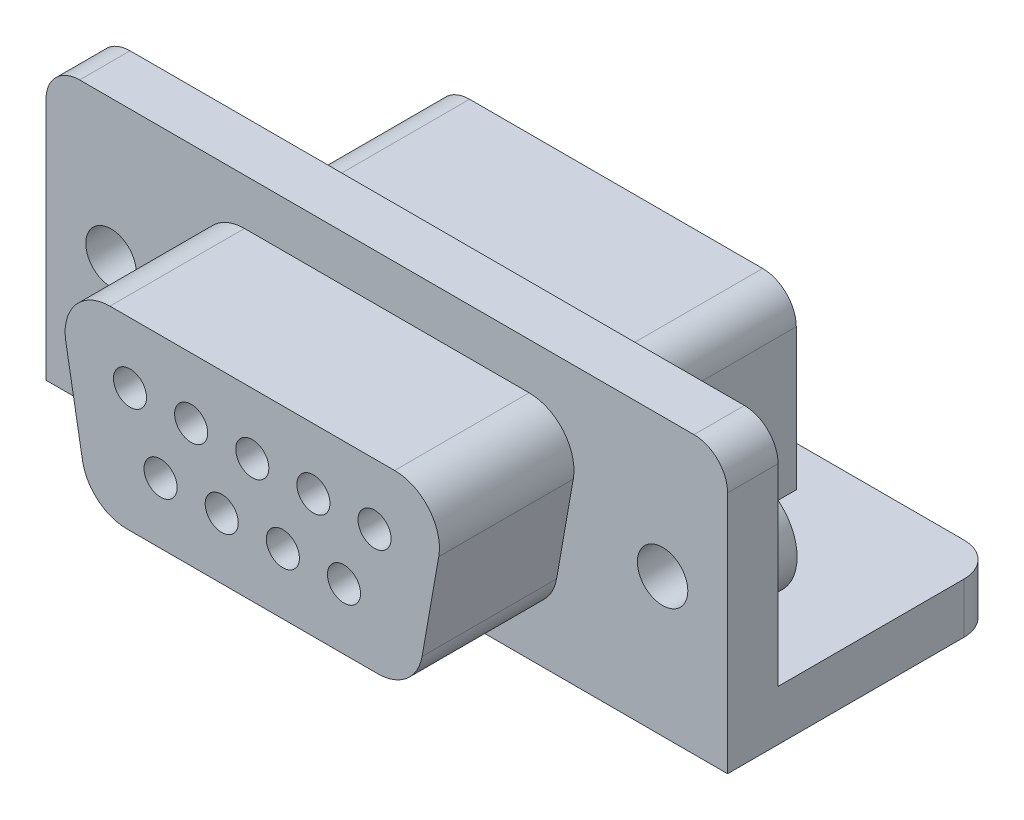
ISO-10303-21;
HEADER;
FILE_DESCRIPTION(('STEP AP214'),'2;1');
FILE_NAME('part.step','',(''),(''),'','','');
FILE_SCHEMA(('AUTOMOTIVE_DESIGN { 1 0 10303 214 1 1 1 1 }'));
ENDSEC;
DATA;
#1=APPLICATION_CONTEXT('core data for automotive mechanical design processes');
#2=APPLICATION_PROTOCOL_DEFINITION('international standard','automotive_design',2000,#1);
#3=PRODUCT_CONTEXT('',#1,'mechanical');
#4=PRODUCT('Part','Part','',(#3));
#5=PRODUCT_RELATED_PRODUCT_CATEGORY('part','',(#4));
#6=PRODUCT_DEFINITION_FORMATION('','',#4);
#7=PRODUCT_DEFINITION_CONTEXT('part definition',#1,'design');
#8=PRODUCT_DEFINITION('design','',#6,#7);
#9=PRODUCT_DEFINITION_SHAPE('','',#8);
#10=(LENGTH_UNIT() NAMED_UNIT(*) SI_UNIT(.MILLI.,.METRE.));
#11=(NAMED_UNIT(*) PLANE_ANGLE_UNIT() SI_UNIT($,.RADIAN.));
#12=(NAMED_UNIT(*) SI_UNIT($,.STERADIAN.) SOLID_ANGLE_UNIT());
#13=UNCERTAINTY_MEASURE_WITH_UNIT(LENGTH_MEASURE(1.E-05),#10,'distance_accuracy_value','');
#14=(GEOMETRIC_REPRESENTATION_CONTEXT(3) GLOBAL_UNCERTAINTY_ASSIGNED_CONTEXT((#13)) GLOBAL_UNIT_ASSIGNED_CONTEXT((#10,
#11,#12)) REPRESENTATION_CONTEXT('',''));
#15=CARTESIAN_POINT('',(0.,0.,0.));
#16=DIRECTION('',(0.,0.,1.));
#17=DIRECTION('',(1.,0.,0.));
#18=AXIS2_PLACEMENT_3D('',#15,#16,#17);
#19=CARTESIAN_POINT('',(8.9943293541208,8.4218,8.382));
#20=DIRECTION('',(0.,0.,-1.));
#21=DIRECTION('',(-1.,0.,0.));
#22=AXIS2_PLACEMENT_3D('',#19,#20,#21);
#23=PLANE('',#22);
#24=CARTESIAN_POINT('',(16.8282,4.853800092,8.382));
#25=DIRECTION('',(0.,0.,-1.));
#26=DIRECTION('',(-1.,0.,0.));
#27=AXIS2_PLACEMENT_3D('',#24,#25,#26);
#28=CIRCLE('',#27,0.750000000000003);
#29=CARTESIAN_POINT('',(16.0782,4.853800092,8.382));
#30=VERTEX_POINT('',#29);
#31=EDGE_CURVE('E519',#30,#30,#28,.T.);
#32=ORIENTED_EDGE('',*,*,#31,.T.);
#33=EDGE_LOOP('',(#32));
#34=FACE_BOUND('',#33,.T.);
#35=CARTESIAN_POINT('',(20.9832,7.6938,8.382));
#36=DIRECTION('',(0.,0.,-1.));
#37=DIRECTION('',(-1.,0.,0.));
#38=AXIS2_PLACEMENT_3D('',#35,#36,#37);
#39=CIRCLE('',#38,0.749999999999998);
#40=CARTESIAN_POINT('',(20.2332,7.6938,8.382));
#41=VERTEX_POINT('',#40);
#42=EDGE_CURVE('E530',#41,#41,#39,.T.);
#43=ORIENTED_EDGE('',*,*,#42,.T.);
#44=EDGE_LOOP('',(#43));
#45=FACE_BOUND('',#44,.T.);
#46=CARTESIAN_POINT('',(15.4432,7.6938,8.382));
#47=DIRECTION('',(0.,0.,1.));
#48=DIRECTION('',(1.,0.,0.));
#49=AXIS2_PLACEMENT_3D('',#46,#47,#48);
#50=CIRCLE('',#49,0.750000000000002);
#51=CARTESIAN_POINT('',(16.1932,7.6938,8.382));
#52=VERTEX_POINT('',#51);
#53=EDGE_CURVE('E535',#52,#52,#50,.T.);
#54=ORIENTED_EDGE('',*,*,#53,.F.);
#55=EDGE_LOOP('',(#54));
#56=FACE_BOUND('',#55,.T.);
#57=CARTESIAN_POINT('',(14.0582,4.853800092,8.382));
#58=DIRECTION('',(0.,0.,1.));
#59=DIRECTION('',(1.,0.,0.));
#60=AXIS2_PLACEMENT_3D('',#57,#58,#59);
#61=CIRCLE('',#60,0.75);
#62=CARTESIAN_POINT('',(14.8082,4.853800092,8.382));
#63=VERTEX_POINT('',#62);
#64=EDGE_CURVE('E541',#63,#63,#61,.T.);
#65=ORIENTED_EDGE('',*,*,#64,.F.);
#66=EDGE_LOOP('',(#65));
#67=FACE_BOUND('',#66,.T.);
#68=CARTESIAN_POINT('',(12.6732,7.6938,8.382));
#69=DIRECTION('',(0.,0.,1.));
#70=DIRECTION('',(1.,0.,0.));
#71=AXIS2_PLACEMENT_3D('',#68,#69,#70);
#72=CIRCLE('',#71,0.75);
#73=CARTESIAN_POINT('',(13.4232,7.6938,8.382));
#74=VERTEX_POINT('',#73);
#75=EDGE_CURVE('E547',#74,#74,#72,.T.);
#76=ORIENTED_EDGE('',*,*,#75,.F.);
#77=EDGE_LOOP('',(#76));
#78=FACE_BOUND('',#77,.T.);
#79=CARTESIAN_POINT('',(11.2882,4.853800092,8.382));
#80=DIRECTION('',(0.,0.,1.));
#81=DIRECTION('',(1.,0.,0.));
#82=AXIS2_PLACEMENT_3D('',#79,#80,#81);
#83=CIRCLE('',#82,0.75);
#84=CARTESIAN_POINT('',(12.0382,4.853800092,8.382));
#85=VERTEX_POINT('',#84);
#86=EDGE_CURVE('E553',#85,#85,#83,.T.);
#87=ORIENTED_EDGE('',*,*,#86,.F.);
#88=EDGE_LOOP('',(#87));
#89=FACE_BOUND('',#88,.T.);
#90=CARTESIAN_POINT('',(9.9032,7.6938,8.382));
#91=DIRECTION('',(0.,0.,1.));
#92=DIRECTION('',(1.,0.,0.));
#93=AXIS2_PLACEMENT_3D('',#90,#91,#92);
#94=CIRCLE('',#93,0.75);
#95=CARTESIAN_POINT('',(10.6532,7.6938,8.382));
#96=VERTEX_POINT('',#95);
#97=EDGE_CURVE('E559',#96,#96,#94,.T.);
#98=ORIENTED_EDGE('',*,*,#97,.F.);
#99=EDGE_LOOP('',(#98));
#100=FACE_BOUND('',#99,.T.);
#101=CARTESIAN_POINT('',(8.9943293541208,8.4218,8.382));
#102=DIRECTION('',(0.,0.,-1.));
#103=DIRECTION('',(-1.,0.,0.));
#104=AXIS2_PLACEMENT_3D('',#101,#102,#103);
#105=CIRCLE('',#104,2.032);
#106=CARTESIAN_POINT('',(6.9932,8.06894690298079,8.382));
#107=VERTEX_POINT('',#106);
#108=CARTESIAN_POINT('',(8.9943293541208,10.4538,8.382));
#109=VERTEX_POINT('',#108);
#110=EDGE_CURVE('E422',#107,#109,#105,.T.);
#111=ORIENTED_EDGE('',*,*,#110,.F.);
#112=DIRECTION('',(0.173648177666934,-0.984807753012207,0.));
#113=VECTOR('',#112,1.);
#114=CARTESIAN_POINT('',(6.9932,8.06894690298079,8.382));
#115=LINE('',#114,#113);
#116=CARTESIAN_POINT('',(7.75070070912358,3.77294690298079,8.382));
#117=VERTEX_POINT('',#116);
#118=EDGE_CURVE('E398',#107,#117,#115,.T.);
#119=ORIENTED_EDGE('',*,*,#118,.T.);
#120=CARTESIAN_POINT('',(9.75183006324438,4.1258,8.382));
#121=DIRECTION('',(0.,0.,1.));
#122=DIRECTION('',(1.,0.,0.));
#123=AXIS2_PLACEMENT_3D('',#120,#121,#122);
#124=CIRCLE('',#123,2.032);
#125=CARTESIAN_POINT('',(9.75183006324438,2.0938,8.382));
#126=VERTEX_POINT('',#125);
#127=EDGE_CURVE('E444',#117,#126,#124,.T.);
#128=ORIENTED_EDGE('',*,*,#127,.T.);
#129=DIRECTION('',(1.,0.,0.));
#130=VECTOR('',#129,1.);
#131=CARTESIAN_POINT('',(9.75183006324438,2.0938,8.382));
#132=LINE('',#131,#130);
#133=CARTESIAN_POINT('',(21.1345699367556,2.0938,8.382));
#134=VERTEX_POINT('',#133);
#135=EDGE_CURVE('E446',#126,#134,#132,.T.);
#136=ORIENTED_EDGE('',*,*,#135,.T.);
#137=CARTESIAN_POINT('',(21.1345699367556,4.1258,8.382));
#138=DIRECTION('',(0.,0.,-1.));
#139=DIRECTION('',(-1.,0.,0.));
#140=AXIS2_PLACEMENT_3D('',#137,#138,#139);
#141=CIRCLE('',#140,2.032);
#142=CARTESIAN_POINT('',(23.1356992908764,3.77294690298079,8.382));
#143=VERTEX_POINT('',#142);
#144=EDGE_CURVE('E448',#143,#134,#141,.T.);
#145=ORIENTED_EDGE('',*,*,#144,.F.);
#146=DIRECTION('',(0.173648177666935,0.984807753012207,0.));
#147=VECTOR('',#146,1.);
#148=CARTESIAN_POINT('',(23.1356992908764,3.77294690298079,8.382));
#149=LINE('',#148,#147);
#150=CARTESIAN_POINT('',(23.8932,8.06894690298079,8.382));
#151=VERTEX_POINT('',#150);
#152=EDGE_CURVE('E451',#143,#151,#149,.T.);
#153=ORIENTED_EDGE('',*,*,#152,.T.);
#154=CARTESIAN_POINT('',(21.8920706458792,8.4218,8.382));
#155=DIRECTION('',(0.,0.,1.));
#156=DIRECTION('',(1.,0.,0.));
#157=AXIS2_PLACEMENT_3D('',#154,#155,#156);
#158=CIRCLE('',#157,2.032);
#159=CARTESIAN_POINT('',(21.8920706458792,10.4538,8.382));
#160=VERTEX_POINT('',#159);
#161=EDGE_CURVE('E453',#151,#160,#158,.T.);
#162=ORIENTED_EDGE('',*,*,#161,.T.);
#163=DIRECTION('',(-1.,0.,0.));
#164=VECTOR('',#163,1.);
#165=CARTESIAN_POINT('',(21.8920706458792,10.4538,8.382));
#166=LINE('',#165,#164);
#167=EDGE_CURVE('E455',#160,#109,#166,.T.);
#168=ORIENTED_EDGE('',*,*,#167,.T.);
#169=EDGE_LOOP('',(#111,#119,#128,#136,#145,#153,#162,#168));
#170=FACE_BOUND('',#169,.T.);
#171=CARTESIAN_POINT('',(18.2132,7.6938,8.382));
#172=DIRECTION('',(0.,0.,-1.));
#173=DIRECTION('',(-1.,0.,0.));
#174=AXIS2_PLACEMENT_3D('',#171,#172,#173);
#175=CIRCLE('',#174,0.750000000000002);
#176=CARTESIAN_POINT('',(17.4632,7.6938,8.382));
#177=VERTEX_POINT('',#176);
#178=EDGE_CURVE('E511',#177,#177,#175,.T.);
#179=ORIENTED_EDGE('',*,*,#178,.T.);
#180=EDGE_LOOP('',(#179));
#181=FACE_BOUND('',#180,.T.);
#182=CARTESIAN_POINT('',(19.5982,4.853800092,8.382));
#183=DIRECTION('',(0.,0.,-1.));
#184=DIRECTION('',(-1.,0.,0.));
#185=AXIS2_PLACEMENT_3D('',#182,#183,#184);
#186=CIRCLE('',#185,0.749999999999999);
#187=CARTESIAN_POINT('',(18.8482,4.853800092,8.382));
#188=VERTEX_POINT('',#187);
#189=EDGE_CURVE('E514',#188,#188,#186,.T.);
#190=ORIENTED_EDGE('',*,*,#189,.T.);
#191=EDGE_LOOP('',(#190));
#192=FACE_BOUND('',#191,.T.);
#193=ADVANCED_FACE('F34',(#34,#45,#56,#67,#78,#89,#100,#170,#181,#192),#23,.F.);
#194=CARTESIAN_POINT('',(0.,0.,0.));
#195=DIRECTION('',(0.,0.,-1.));
#196=DIRECTION('',(-1.,0.,0.));
#197=AXIS2_PLACEMENT_3D('',#194,#195,#196);
#198=PLANE('',#197);
#199=CARTESIAN_POINT('',(27.94,6.27379999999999,0.));
#200=DIRECTION('',(0.,0.,-1.));
#201=DIRECTION('',(-1.,0.,0.));
#202=AXIS2_PLACEMENT_3D('',#199,#200,#201);
#203=CIRCLE('',#202,2.286);
#204=CARTESIAN_POINT('',(30.226,6.27379999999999,0.));
#205=VERTEX_POINT('',#204);
#206=EDGE_CURVE('E254',#205,#205,#203,.T.);
#207=ORIENTED_EDGE('',*,*,#206,.F.);
#208=EDGE_LOOP('',(#207));
#209=FACE_BOUND('',#208,.T.);
#210=CARTESIAN_POINT('',(2.9464,6.27379999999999,0.));
#211=DIRECTION('',(0.,0.,-1.));
#212=DIRECTION('',(-1.,0.,0.));
#213=AXIS2_PLACEMENT_3D('',#210,#211,#212);
#214=CIRCLE('',#213,2.286);
#215=CARTESIAN_POINT('',(5.2324,6.27379999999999,0.));
#216=VERTEX_POINT('',#215);
#217=EDGE_CURVE('E258',#216,#216,#214,.T.);
#218=ORIENTED_EDGE('',*,*,#217,.F.);
#219=EDGE_LOOP('',(#218));
#220=FACE_BOUND('',#219,.T.);
#221=DIRECTION('',(-1.,0.,0.));
#222=VECTOR('',#221,1.);
#223=CARTESIAN_POINT('',(30.8864,2.286,0.));
#224=LINE('',#223,#222);
#225=CARTESIAN_POINT('',(30.8864,2.286,0.));
#226=VERTEX_POINT('',#225);
#227=CARTESIAN_POINT('',(23.5839,2.286,0.));
#228=VERTEX_POINT('',#227);
#229=EDGE_CURVE('E270',#226,#228,#224,.T.);
#230=ORIENTED_EDGE('',*,*,#229,.T.);
#231=DIRECTION('',(0.,-1.,0.));
#232=VECTOR('',#231,1.);
#233=CARTESIAN_POINT('',(23.5839,8.68679999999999,0.));
#234=LINE('',#233,#232);
#235=CARTESIAN_POINT('',(23.5839,8.68679999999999,0.));
#236=VERTEX_POINT('',#235);
#237=EDGE_CURVE('E51',#236,#228,#234,.T.);
#238=ORIENTED_EDGE('',*,*,#237,.F.);
#239=CARTESIAN_POINT('',(22.0599,8.68679999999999,0.));
#240=DIRECTION('',(0.,0.,-1.));
#241=DIRECTION('',(-1.,0.,0.));
#242=AXIS2_PLACEMENT_3D('',#239,#240,#241);
#243=CIRCLE('',#242,1.524);
#244=CARTESIAN_POINT('',(22.0599,10.2108,0.));
#245=VERTEX_POINT('',#244);
#246=EDGE_CURVE('E55',#245,#236,#243,.T.);
#247=ORIENTED_EDGE('',*,*,#246,.F.);
#248=DIRECTION('',(-1.,0.,0.));
#249=VECTOR('',#248,1.);
#250=CARTESIAN_POINT('',(22.0599,10.2108,0.));
#251=LINE('',#250,#249);
#252=CARTESIAN_POINT('',(8.7801940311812,10.2108,0.));
#253=VERTEX_POINT('',#252);
#254=EDGE_CURVE('E233',#245,#253,#251,.T.);
#255=ORIENTED_EDGE('',*,*,#254,.T.);
#256=CARTESIAN_POINT('',(8.7801940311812,8.68679999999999,0.));
#257=DIRECTION('',(0.,0.,-1.));
#258=DIRECTION('',(-1.,0.,0.));
#259=AXIS2_PLACEMENT_3D('',#256,#257,#258);
#260=CIRCLE('',#259,1.524);
#261=CARTESIAN_POINT('',(7.2561940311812,8.68679999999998,0.));
#262=VERTEX_POINT('',#261);
#263=EDGE_CURVE('E212',#262,#253,#260,.T.);
#264=ORIENTED_EDGE('',*,*,#263,.F.);
#265=DIRECTION('',(0.,-1.,0.));
#266=VECTOR('',#265,1.);
#267=CARTESIAN_POINT('',(7.2561940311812,8.68679999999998,0.));
#268=LINE('',#267,#266);
#269=CARTESIAN_POINT('',(7.2561940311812,2.286,0.));
#270=VERTEX_POINT('',#269);
#271=EDGE_CURVE('E206',#262,#270,#268,.T.);
#272=ORIENTED_EDGE('',*,*,#271,.T.);
#273=CARTESIAN_POINT('',(0.,2.286,0.));
#274=VERTEX_POINT('',#273);
#275=EDGE_CURVE('E38',#270,#274,#224,.T.);
#276=ORIENTED_EDGE('',*,*,#275,.T.);
#277=DIRECTION('',(0.,1.,0.));
#278=VECTOR('',#277,1.);
#279=CARTESIAN_POINT('',(0.,0.,0.));
#280=LINE('',#279,#278);
#281=CARTESIAN_POINT('',(0.,11.0236,0.));
#282=VERTEX_POINT('',#281);
#283=EDGE_CURVE('E281',#274,#282,#280,.T.);
#284=ORIENTED_EDGE('',*,*,#283,.T.);
#285=CARTESIAN_POINT('',(1.524,11.0236,0.));
#286=DIRECTION('',(0.,0.,-1.));
#287=DIRECTION('',(-1.,0.,0.));
#288=AXIS2_PLACEMENT_3D('',#285,#286,#287);
#289=CIRCLE('',#288,1.524);
#290=CARTESIAN_POINT('',(1.524,12.5476,0.));
#291=VERTEX_POINT('',#290);
#292=EDGE_CURVE('E355',#282,#291,#289,.T.);
#293=ORIENTED_EDGE('',*,*,#292,.T.);
#294=DIRECTION('',(-1.,0.,0.));
#295=VECTOR('',#294,1.);
#296=CARTESIAN_POINT('',(30.8864,12.5476,0.));
#297=LINE('',#296,#295);
#298=CARTESIAN_POINT('',(29.3624,12.5476,0.));
#299=VERTEX_POINT('',#298);
#300=EDGE_CURVE('E333',#299,#291,#297,.T.);
#301=ORIENTED_EDGE('',*,*,#300,.F.);
#302=CARTESIAN_POINT('',(29.3624,11.0236,0.));
#303=DIRECTION('',(0.,0.,-1.));
#304=DIRECTION('',(-1.,0.,0.));
#305=AXIS2_PLACEMENT_3D('',#302,#303,#304);
#306=CIRCLE('',#305,1.524);
#307=CARTESIAN_POINT('',(30.8864,11.0236,0.));
#308=VERTEX_POINT('',#307);
#309=EDGE_CURVE('E331',#299,#308,#306,.T.);
#310=ORIENTED_EDGE('',*,*,#309,.T.);
#311=DIRECTION('',(0.,-1.,0.));
#312=VECTOR('',#311,1.);
#313=CARTESIAN_POINT('',(30.8864,12.5476,0.));
#314=LINE('',#313,#312);
#315=EDGE_CURVE('E326',#308,#226,#314,.T.);
#316=ORIENTED_EDGE('',*,*,#315,.T.);
#317=EDGE_LOOP('',(#230,#238,#247,#255,#264,#272,#276,#284,#293,#301,#310,#316));
#318=FACE_BOUND('',#317,.T.);
#319=ADVANCED_FACE('F329',(#209,#220,#318),#198,.T.);
#320=CARTESIAN_POINT('',(30.8864,2.286,-9.9568));
#321=DIRECTION('',(0.,1.,0.));
#322=DIRECTION('',(0.,0.,1.));
#323=AXIS2_PLACEMENT_3D('',#320,#321,#322);
#324=PLANE('',#323);
#325=DIRECTION('',(-1.,0.,0.));
#326=VECTOR('',#325,1.);
#327=CARTESIAN_POINT('',(23.5839,2.286,-8.128));
#328=LINE('',#327,#326);
#329=CARTESIAN_POINT('',(23.5839,2.286,-8.128));
#330=VERTEX_POINT('',#329);
#331=CARTESIAN_POINT('',(7.2561940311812,2.286,-8.128));
#332=VERTEX_POINT('',#331);
#333=EDGE_CURVE('E228',#330,#332,#328,.T.);
#334=ORIENTED_EDGE('',*,*,#333,.F.);
#335=DIRECTION('',(0.,0.,1.));
#336=VECTOR('',#335,1.);
#337=CARTESIAN_POINT('',(23.5839,2.286,-8.128));
#338=LINE('',#337,#336);
#339=EDGE_CURVE('E243',#330,#228,#338,.T.);
#340=ORIENTED_EDGE('',*,*,#339,.T.);
#341=ORIENTED_EDGE('',*,*,#229,.F.);
#342=DIRECTION('',(0.,0.,1.));
#343=VECTOR('',#342,1.);
#344=CARTESIAN_POINT('',(30.8864,2.286,-9.9568));
#345=LINE('',#344,#343);
#346=CARTESIAN_POINT('',(30.8864,2.286,-8.4328));
#347=VERTEX_POINT('',#346);
#348=EDGE_CURVE('E272',#347,#226,#345,.T.);
#349=ORIENTED_EDGE('',*,*,#348,.F.);
#350=CARTESIAN_POINT('',(29.3624,2.286,-8.4328));
#351=DIRECTION('',(0.,1.,0.));
#352=DIRECTION('',(0.,0.,1.));
#353=AXIS2_PLACEMENT_3D('',#350,#351,#352);
#354=CIRCLE('',#353,1.524);
#355=CARTESIAN_POINT('',(29.3624,2.286,-9.9568));
#356=VERTEX_POINT('',#355);
#357=EDGE_CURVE('E44',#347,#356,#354,.T.);
#358=ORIENTED_EDGE('',*,*,#357,.T.);
#359=DIRECTION('',(-1.,0.,0.));
#360=VECTOR('',#359,1.);
#361=CARTESIAN_POINT('',(30.8864,2.286,-9.9568));
#362=LINE('',#361,#360);
#363=CARTESIAN_POINT('',(1.524,2.286,-9.9568));
#364=VERTEX_POINT('',#363);
#365=EDGE_CURVE('E266',#356,#364,#362,.T.);
#366=ORIENTED_EDGE('',*,*,#365,.T.);
#367=CARTESIAN_POINT('',(1.524,2.286,-8.4328));
#368=DIRECTION('',(0.,1.,0.));
#369=DIRECTION('',(0.,0.,1.));
#370=AXIS2_PLACEMENT_3D('',#367,#368,#369);
#371=CIRCLE('',#370,1.524);
#372=CARTESIAN_POINT('',(0.,2.286,-8.4328));
#373=VERTEX_POINT('',#372);
#374=EDGE_CURVE('E295',#364,#373,#371,.T.);
#375=ORIENTED_EDGE('',*,*,#374,.T.);
#376=DIRECTION('',(0.,0.,1.));
#377=VECTOR('',#376,1.);
#378=CARTESIAN_POINT('',(0.,2.286,-9.9568));
#379=LINE('',#378,#377);
#380=EDGE_CURVE('E289',#373,#274,#379,.T.);
#381=ORIENTED_EDGE('',*,*,#380,.T.);
#382=ORIENTED_EDGE('',*,*,#275,.F.);
#383=DIRECTION('',(0.,0.,1.));
#384=VECTOR('',#383,1.);
#385=CARTESIAN_POINT('',(7.2561940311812,2.286,-8.128));
#386=LINE('',#385,#384);
#387=EDGE_CURVE('E240',#332,#270,#386,.T.);
#388=ORIENTED_EDGE('',*,*,#387,.F.);
#389=EDGE_LOOP('',(#334,#340,#341,#349,#358,#366,#375,#381,#382,#388));
#390=FACE_BOUND('',#389,.T.);
#391=ADVANCED_FACE('F301',(#390),#324,.T.);
#392=CARTESIAN_POINT('',(0.,0.,2.286));
#393=DIRECTION('',(-1.,0.,0.));
#394=DIRECTION('',(0.,0.,1.));
#395=AXIS2_PLACEMENT_3D('',#392,#393,#394);
#396=PLANE('',#395);
#397=ORIENTED_EDGE('',*,*,#380,.F.);
#398=DIRECTION('',(0.,1.,0.));
#399=VECTOR('',#398,1.);
#400=CARTESIAN_POINT('',(0.,0.,-8.4328));
#401=LINE('',#400,#399);
#402=CARTESIAN_POINT('',(0.,0.,-8.4328));
#403=VERTEX_POINT('',#402);
#404=EDGE_CURVE('E11',#373,#403,#401,.F.);
#405=ORIENTED_EDGE('',*,*,#404,.T.);
#406=DIRECTION('',(0.,0.,-1.));
#407=VECTOR('',#406,1.);
#408=CARTESIAN_POINT('',(0.,0.,2.286));
#409=LINE('',#408,#407);
#410=CARTESIAN_POINT('',(0.,0.,2.286));
#411=VERTEX_POINT('',#410);
#412=EDGE_CURVE('E344',#411,#403,#409,.T.);
#413=ORIENTED_EDGE('',*,*,#412,.F.);
#414=DIRECTION('',(0.,1.,0.));
#415=VECTOR('',#414,1.);
#416=CARTESIAN_POINT('',(0.,0.,2.286));
#417=LINE('',#416,#415);
#418=CARTESIAN_POINT('',(0.,11.0236,2.286));
#419=VERTEX_POINT('',#418);
#420=EDGE_CURVE('E332',#411,#419,#417,.T.);
#421=ORIENTED_EDGE('',*,*,#420,.T.);
#422=DIRECTION('',(0.,0.,-1.));
#423=VECTOR('',#422,1.);
#424=CARTESIAN_POINT('',(0.,11.0236,0.));
#425=LINE('',#424,#423);
#426=EDGE_CURVE('E319',#419,#282,#425,.T.);
#427=ORIENTED_EDGE('',*,*,#426,.T.);
#428=ORIENTED_EDGE('',*,*,#283,.F.);
#429=EDGE_LOOP('',(#397,#405,#413,#421,#427,#428));
#430=FACE_BOUND('',#429,.T.);
#431=ADVANCED_FACE('F372',(#430),#396,.T.);
#432=CARTESIAN_POINT('',(0.,0.,2.286));
#433=DIRECTION('',(0.,1.,0.));
#434=DIRECTION('',(0.,0.,1.));
#435=AXIS2_PLACEMENT_3D('',#432,#433,#434);
#436=PLANE('',#435);
#437=DIRECTION('',(1.,0.,0.));
#438=VECTOR('',#437,1.);
#439=CARTESIAN_POINT('',(0.,0.,-9.9568));
#440=LINE('',#439,#438);
#441=CARTESIAN_POINT('',(1.524,0.,-9.9568));
#442=VERTEX_POINT('',#441);
#443=CARTESIAN_POINT('',(29.3624,0.,-9.9568));
#444=VERTEX_POINT('',#443);
#445=EDGE_CURVE('E269',#442,#444,#440,.T.);
#446=ORIENTED_EDGE('',*,*,#445,.T.);
#447=CARTESIAN_POINT('',(29.3624,0.,-8.4328));
#448=DIRECTION('',(0.,1.,0.));
#449=DIRECTION('',(0.,0.,1.));
#450=AXIS2_PLACEMENT_3D('',#447,#448,#449);
#451=CIRCLE('',#450,1.524);
#452=CARTESIAN_POINT('',(30.8864,0.,-8.4328));
#453=VERTEX_POINT('',#452);
#454=EDGE_CURVE('E315',#444,#453,#451,.F.);
#455=ORIENTED_EDGE('',*,*,#454,.T.);
#456=DIRECTION('',(0.,0.,-1.));
#457=VECTOR('',#456,1.);
#458=CARTESIAN_POINT('',(30.8864,0.,2.286));
#459=LINE('',#458,#457);
#460=CARTESIAN_POINT('',(30.8864,0.,2.286));
#461=VERTEX_POINT('',#460);
#462=EDGE_CURVE('E348',#461,#453,#459,.T.);
#463=ORIENTED_EDGE('',*,*,#462,.F.);
#464=DIRECTION('',(1.,0.,0.));
#465=VECTOR('',#464,1.);
#466=CARTESIAN_POINT('',(0.,0.,2.286));
#467=LINE('',#466,#465);
#468=EDGE_CURVE('E350',#411,#461,#467,.T.);
#469=ORIENTED_EDGE('',*,*,#468,.F.);
#470=ORIENTED_EDGE('',*,*,#412,.T.);
#471=CARTESIAN_POINT('',(1.524,0.,-8.4328));
#472=DIRECTION('',(0.,1.,0.));
#473=DIRECTION('',(0.,0.,1.));
#474=AXIS2_PLACEMENT_3D('',#471,#472,#473);
#475=CIRCLE('',#474,1.524);
#476=EDGE_CURVE('E316',#403,#442,#475,.F.);
#477=ORIENTED_EDGE('',*,*,#476,.T.);
#478=EDGE_LOOP('',(#446,#455,#463,#469,#470,#477));
#479=FACE_BOUND('',#478,.T.);
#480=ADVANCED_FACE('F643',(#479),#436,.F.);
#481=CARTESIAN_POINT('',(30.8864,12.5476,2.286));
#482=DIRECTION('',(1.,0.,0.));
#483=DIRECTION('',(0.,1.,0.));
#484=AXIS2_PLACEMENT_3D('',#481,#482,#483);
#485=PLANE('',#484);
#486=ORIENTED_EDGE('',*,*,#462,.T.);
#487=DIRECTION('',(0.,-1.,0.));
#488=VECTOR('',#487,1.);
#489=CARTESIAN_POINT('',(30.8864,2.286,-8.4328));
#490=LINE('',#489,#488);
#491=EDGE_CURVE('E293',#453,#347,#490,.F.);
#492=ORIENTED_EDGE('',*,*,#491,.T.);
#493=ORIENTED_EDGE('',*,*,#348,.T.);
#494=ORIENTED_EDGE('',*,*,#315,.F.);
#495=DIRECTION('',(0.,0.,-1.));
#496=VECTOR('',#495,1.);
#497=CARTESIAN_POINT('',(30.8864,11.0236,2.286));
#498=LINE('',#497,#496);
#499=CARTESIAN_POINT('',(30.8864,11.0236,2.286));
#500=VERTEX_POINT('',#499);
#501=EDGE_CURVE('E358',#308,#500,#498,.F.);
#502=ORIENTED_EDGE('',*,*,#501,.T.);
#503=DIRECTION('',(0.,-1.,0.));
#504=VECTOR('',#503,1.);
#505=CARTESIAN_POINT('',(30.8864,12.5476,2.286));
#506=LINE('',#505,#504);
#507=EDGE_CURVE('E384',#500,#461,#506,.T.);
#508=ORIENTED_EDGE('',*,*,#507,.T.);
#509=EDGE_LOOP('',(#486,#492,#493,#494,#502,#508));
#510=FACE_BOUND('',#509,.T.);
#511=ADVANCED_FACE('F324',(#510),#485,.T.);
#512=CARTESIAN_POINT('',(30.8864,12.5476,2.286));
#513=DIRECTION('',(0.,-1.,0.));
#514=DIRECTION('',(1.,0.,0.));
#515=AXIS2_PLACEMENT_3D('',#512,#513,#514);
#516=PLANE('',#515);
#517=DIRECTION('',(-1.,0.,0.));
#518=VECTOR('',#517,1.);
#519=CARTESIAN_POINT('',(30.8864,12.5476,2.286));
#520=LINE('',#519,#518);
#521=CARTESIAN_POINT('',(29.3624,12.5476,2.286));
#522=VERTEX_POINT('',#521);
#523=CARTESIAN_POINT('',(1.524,12.5476,2.286));
#524=VERTEX_POINT('',#523);
#525=EDGE_CURVE('E335',#522,#524,#520,.T.);
#526=ORIENTED_EDGE('',*,*,#525,.F.);
#527=DIRECTION('',(0.,0.,-1.));
#528=VECTOR('',#527,1.);
#529=CARTESIAN_POINT('',(29.3624,12.5476,0.));
#530=LINE('',#529,#528);
#531=EDGE_CURVE('E352',#522,#299,#530,.T.);
#532=ORIENTED_EDGE('',*,*,#531,.T.);
#533=ORIENTED_EDGE('',*,*,#300,.T.);
#534=DIRECTION('',(0.,0.,-1.));
#535=VECTOR('',#534,1.);
#536=CARTESIAN_POINT('',(1.524,12.5476,2.286));
#537=LINE('',#536,#535);
#538=EDGE_CURVE('E347',#291,#524,#537,.F.);
#539=ORIENTED_EDGE('',*,*,#538,.T.);
#540=EDGE_LOOP('',(#526,#532,#533,#539));
#541=FACE_BOUND('',#540,.T.);
#542=ADVANCED_FACE('F380',(#541),#516,.F.);
#543=CARTESIAN_POINT('',(0.,0.,2.286));
#544=DIRECTION('',(0.,0.,-1.));
#545=DIRECTION('',(-1.,0.,0.));
#546=AXIS2_PLACEMENT_3D('',#543,#544,#545);
#547=PLANE('',#546);
#548=CARTESIAN_POINT('',(2.9464,6.27379999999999,2.286));
#549=DIRECTION('',(0.,0.,1.));
#550=DIRECTION('',(1.,0.,0.));
#551=AXIS2_PLACEMENT_3D('',#548,#549,#550);
#552=CIRCLE('',#551,1.143);
#553=CARTESIAN_POINT('',(4.0894,6.27379999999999,2.286));
#554=VERTEX_POINT('',#553);
#555=EDGE_CURVE('E275',#554,#554,#552,.T.);
#556=ORIENTED_EDGE('',*,*,#555,.F.);
#557=EDGE_LOOP('',(#556));
#558=FACE_BOUND('',#557,.T.);
#559=CARTESIAN_POINT('',(27.94,6.27379999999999,2.286));
#560=DIRECTION('',(0.,0.,1.));
#561=DIRECTION('',(1.,0.,0.));
#562=AXIS2_PLACEMENT_3D('',#559,#560,#561);
#563=CIRCLE('',#562,1.143);
#564=CARTESIAN_POINT('',(29.083,6.27379999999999,2.286));
#565=VERTEX_POINT('',#564);
#566=EDGE_CURVE('E442',#565,#565,#563,.T.);
#567=ORIENTED_EDGE('',*,*,#566,.F.);
#568=EDGE_LOOP('',(#567));
#569=FACE_BOUND('',#568,.T.);
#570=DIRECTION('',(0.173648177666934,-0.984807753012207,0.));
#571=VECTOR('',#570,1.);
#572=CARTESIAN_POINT('',(6.9932,8.06894690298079,2.286));
#573=LINE('',#572,#571);
#574=CARTESIAN_POINT('',(6.9932,8.06894690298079,2.286));
#575=VERTEX_POINT('',#574);
#576=CARTESIAN_POINT('',(7.75070070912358,3.77294690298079,2.286));
#577=VERTEX_POINT('',#576);
#578=EDGE_CURVE('E419',#575,#577,#573,.T.);
#579=ORIENTED_EDGE('',*,*,#578,.F.);
#580=CARTESIAN_POINT('',(8.9943293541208,8.4218,2.286));
#581=DIRECTION('',(0.,0.,-1.));
#582=DIRECTION('',(-1.,0.,0.));
#583=AXIS2_PLACEMENT_3D('',#580,#581,#582);
#584=CIRCLE('',#583,2.032);
#585=CARTESIAN_POINT('',(8.9943293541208,10.4538,2.286));
#586=VERTEX_POINT('',#585);
#587=EDGE_CURVE('E440',#575,#586,#584,.T.);
#588=ORIENTED_EDGE('',*,*,#587,.T.);
#589=DIRECTION('',(-1.,0.,0.));
#590=VECTOR('',#589,1.);
#591=CARTESIAN_POINT('',(21.8920706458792,10.4538,2.286));
#592=LINE('',#591,#590);
#593=CARTESIAN_POINT('',(21.8920706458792,10.4538,2.286));
#594=VERTEX_POINT('',#593);
#595=EDGE_CURVE('E437',#594,#586,#592,.T.);
#596=ORIENTED_EDGE('',*,*,#595,.F.);
#597=CARTESIAN_POINT('',(21.8920706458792,8.4218,2.286));
#598=DIRECTION('',(0.,0.,1.));
#599=DIRECTION('',(1.,0.,0.));
#600=AXIS2_PLACEMENT_3D('',#597,#598,#599);
#601=CIRCLE('',#600,2.032);
#602=CARTESIAN_POINT('',(23.8932,8.06894690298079,2.286));
#603=VERTEX_POINT('',#602);
#604=EDGE_CURVE('E434',#603,#594,#601,.T.);
#605=ORIENTED_EDGE('',*,*,#604,.F.);
#606=DIRECTION('',(0.173648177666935,0.984807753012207,0.));
#607=VECTOR('',#606,1.);
#608=CARTESIAN_POINT('',(23.1356992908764,3.77294690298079,2.286));
#609=LINE('',#608,#607);
#610=CARTESIAN_POINT('',(23.1356992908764,3.77294690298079,2.286));
#611=VERTEX_POINT('',#610);
#612=EDGE_CURVE('E431',#611,#603,#609,.T.);
#613=ORIENTED_EDGE('',*,*,#612,.F.);
#614=CARTESIAN_POINT('',(21.1345699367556,4.1258,2.286));
#615=DIRECTION('',(0.,0.,-1.));
#616=DIRECTION('',(-1.,0.,0.));
#617=AXIS2_PLACEMENT_3D('',#614,#615,#616);
#618=CIRCLE('',#617,2.032);
#619=CARTESIAN_POINT('',(21.1345699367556,2.0938,2.286));
#620=VERTEX_POINT('',#619);
#621=EDGE_CURVE('E429',#611,#620,#618,.T.);
#622=ORIENTED_EDGE('',*,*,#621,.T.);
#623=DIRECTION('',(1.,0.,0.));
#624=VECTOR('',#623,1.);
#625=CARTESIAN_POINT('',(9.75183006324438,2.0938,2.286));
#626=LINE('',#625,#624);
#627=CARTESIAN_POINT('',(9.75183006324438,2.0938,2.286));
#628=VERTEX_POINT('',#627);
#629=EDGE_CURVE('E426',#628,#620,#626,.T.);
#630=ORIENTED_EDGE('',*,*,#629,.F.);
#631=CARTESIAN_POINT('',(9.75183006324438,4.1258,2.286));
#632=DIRECTION('',(0.,0.,1.));
#633=DIRECTION('',(1.,0.,0.));
#634=AXIS2_PLACEMENT_3D('',#631,#632,#633);
#635=CIRCLE('',#634,2.032);
#636=EDGE_CURVE('E423',#577,#628,#635,.T.);
#637=ORIENTED_EDGE('',*,*,#636,.F.);
#638=EDGE_LOOP('',(#579,#588,#596,#605,#613,#622,#630,#637));
#639=FACE_BOUND('',#638,.T.);
#640=ORIENTED_EDGE('',*,*,#507,.F.);
#641=CARTESIAN_POINT('',(29.3624,11.0236,2.286));
#642=DIRECTION('',(0.,0.,-1.));
#643=DIRECTION('',(-1.,0.,0.));
#644=AXIS2_PLACEMENT_3D('',#641,#642,#643);
#645=CIRCLE('',#644,1.524);
#646=EDGE_CURVE('E361',#500,#522,#645,.F.);
#647=ORIENTED_EDGE('',*,*,#646,.T.);
#648=ORIENTED_EDGE('',*,*,#525,.T.);
#649=CARTESIAN_POINT('',(1.524,11.0236,2.286));
#650=DIRECTION('',(0.,0.,-1.));
#651=DIRECTION('',(-1.,0.,0.));
#652=AXIS2_PLACEMENT_3D('',#649,#650,#651);
#653=CIRCLE('',#652,1.524);
#654=EDGE_CURVE('E360',#524,#419,#653,.F.);
#655=ORIENTED_EDGE('',*,*,#654,.T.);
#656=ORIENTED_EDGE('',*,*,#420,.F.);
#657=ORIENTED_EDGE('',*,*,#468,.T.);
#658=EDGE_LOOP('',(#640,#647,#648,#655,#656,#657));
#659=FACE_BOUND('',#658,.T.);
#660=ADVANCED_FACE('F386',(#558,#569,#639,#659),#547,.F.);
#661=CARTESIAN_POINT('',(8.9943293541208,8.4218,8.382));
#662=DIRECTION('',(0.,0.,-1.));
#663=DIRECTION('',(-1.,0.,0.));
#664=AXIS2_PLACEMENT_3D('',#661,#662,#663);
#665=CYLINDRICAL_SURFACE('',#664,2.032);
#666=ORIENTED_EDGE('',*,*,#587,.F.);
#667=DIRECTION('',(0.,0.,-1.));
#668=VECTOR('',#667,1.);
#669=CARTESIAN_POINT('',(6.9932,8.06894690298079,8.382));
#670=LINE('',#669,#668);
#671=EDGE_CURVE('E416',#107,#575,#670,.T.);
#672=ORIENTED_EDGE('',*,*,#671,.F.);
#673=ORIENTED_EDGE('',*,*,#110,.T.);
#674=DIRECTION('',(0.,0.,-1.));
#675=VECTOR('',#674,1.);
#676=CARTESIAN_POINT('',(8.9943293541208,10.4538,8.382));
#677=LINE('',#676,#675);
#678=EDGE_CURVE('E394',#109,#586,#677,.T.);
#679=ORIENTED_EDGE('',*,*,#678,.T.);
#680=EDGE_LOOP('',(#666,#672,#673,#679));
#681=FACE_BOUND('',#680,.T.);
#682=ADVANCED_FACE('F469',(#681),#665,.T.);
#683=CARTESIAN_POINT('',(6.9932,8.06894690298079,8.382));
#684=DIRECTION('',(0.984807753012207,0.173648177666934,0.));
#685=DIRECTION('',(-0.173648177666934,0.984807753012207,0.));
#686=AXIS2_PLACEMENT_3D('',#683,#684,#685);
#687=PLANE('',#686);
#688=ORIENTED_EDGE('',*,*,#578,.T.);
#689=DIRECTION('',(0.,0.,-1.));
#690=VECTOR('',#689,1.);
#691=CARTESIAN_POINT('',(7.75070070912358,3.77294690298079,8.382));
#692=LINE('',#691,#690);
#693=EDGE_CURVE('E413',#117,#577,#692,.T.);
#694=ORIENTED_EDGE('',*,*,#693,.F.);
#695=ORIENTED_EDGE('',*,*,#118,.F.);
#696=ORIENTED_EDGE('',*,*,#671,.T.);
#697=EDGE_LOOP('',(#688,#694,#695,#696));
#698=FACE_BOUND('',#697,.T.);
#699=ADVANCED_FACE('F476',(#698),#687,.F.);
#700=CARTESIAN_POINT('',(9.75183006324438,4.1258,8.382));
#701=DIRECTION('',(0.,0.,-1.));
#702=DIRECTION('',(-1.,0.,0.));
#703=AXIS2_PLACEMENT_3D('',#700,#701,#702);
#704=CYLINDRICAL_SURFACE('',#703,2.032);
#705=ORIENTED_EDGE('',*,*,#636,.T.);
#706=DIRECTION('',(0.,0.,-1.));
#707=VECTOR('',#706,1.);
#708=CARTESIAN_POINT('',(9.75183006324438,2.0938,8.382));
#709=LINE('',#708,#707);
#710=EDGE_CURVE('E410',#126,#628,#709,.T.);
#711=ORIENTED_EDGE('',*,*,#710,.F.);
#712=ORIENTED_EDGE('',*,*,#127,.F.);
#713=ORIENTED_EDGE('',*,*,#693,.T.);
#714=EDGE_LOOP('',(#705,#711,#712,#713));
#715=FACE_BOUND('',#714,.T.);
#716=ADVANCED_FACE('F502',(#715),#704,.T.);
#717=CARTESIAN_POINT('',(9.75183006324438,2.0938,8.382));
#718=DIRECTION('',(0.,1.,0.));
#719=DIRECTION('',(-1.,0.,0.));
#720=AXIS2_PLACEMENT_3D('',#717,#718,#719);
#721=PLANE('',#720);
#722=ORIENTED_EDGE('',*,*,#629,.T.);
#723=DIRECTION('',(0.,0.,-1.));
#724=VECTOR('',#723,1.);
#725=CARTESIAN_POINT('',(21.1345699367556,2.0938,8.382));
#726=LINE('',#725,#724);
#727=EDGE_CURVE('E407',#134,#620,#726,.T.);
#728=ORIENTED_EDGE('',*,*,#727,.F.);
#729=ORIENTED_EDGE('',*,*,#135,.F.);
#730=ORIENTED_EDGE('',*,*,#710,.T.);
#731=EDGE_LOOP('',(#722,#728,#729,#730));
#732=FACE_BOUND('',#731,.T.);
#733=ADVANCED_FACE('F498',(#732),#721,.F.);
#734=CARTESIAN_POINT('',(21.1345699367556,4.1258,8.382));
#735=DIRECTION('',(0.,0.,-1.));
#736=DIRECTION('',(-1.,0.,0.));
#737=AXIS2_PLACEMENT_3D('',#734,#735,#736);
#738=CYLINDRICAL_SURFACE('',#737,2.032);
#739=ORIENTED_EDGE('',*,*,#621,.F.);
#740=DIRECTION('',(0.,0.,-1.));
#741=VECTOR('',#740,1.);
#742=CARTESIAN_POINT('',(23.1356992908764,3.77294690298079,8.382));
#743=LINE('',#742,#741);
#744=EDGE_CURVE('E404',#143,#611,#743,.T.);
#745=ORIENTED_EDGE('',*,*,#744,.F.);
#746=ORIENTED_EDGE('',*,*,#144,.T.);
#747=ORIENTED_EDGE('',*,*,#727,.T.);
#748=EDGE_LOOP('',(#739,#745,#746,#747));
#749=FACE_BOUND('',#748,.T.);
#750=ADVANCED_FACE('F495',(#749),#738,.T.);
#751=CARTESIAN_POINT('',(23.1356992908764,3.77294690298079,8.382));
#752=DIRECTION('',(-0.984807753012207,0.173648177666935,0.));
#753=DIRECTION('',(-0.173648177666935,-0.984807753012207,0.));
#754=AXIS2_PLACEMENT_3D('',#751,#752,#753);
#755=PLANE('',#754);
#756=ORIENTED_EDGE('',*,*,#612,.T.);
#757=DIRECTION('',(0.,0.,-1.));
#758=VECTOR('',#757,1.);
#759=CARTESIAN_POINT('',(23.8932,8.06894690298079,8.382));
#760=LINE('',#759,#758);
#761=EDGE_CURVE('E401',#151,#603,#760,.T.);
#762=ORIENTED_EDGE('',*,*,#761,.F.);
#763=ORIENTED_EDGE('',*,*,#152,.F.);
#764=ORIENTED_EDGE('',*,*,#744,.T.);
#765=EDGE_LOOP('',(#756,#762,#763,#764));
#766=FACE_BOUND('',#765,.T.);
#767=ADVANCED_FACE('F490',(#766),#755,.F.);
#768=CARTESIAN_POINT('',(21.8920706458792,8.4218,8.382));
#769=DIRECTION('',(0.,0.,-1.));
#770=DIRECTION('',(-1.,0.,0.));
#771=AXIS2_PLACEMENT_3D('',#768,#769,#770);
#772=CYLINDRICAL_SURFACE('',#771,2.032);
#773=ORIENTED_EDGE('',*,*,#604,.T.);
#774=DIRECTION('',(0.,0.,-1.));
#775=VECTOR('',#774,1.);
#776=CARTESIAN_POINT('',(21.8920706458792,10.4538,8.382));
#777=LINE('',#776,#775);
#778=EDGE_CURVE('E397',#160,#594,#777,.T.);
#779=ORIENTED_EDGE('',*,*,#778,.F.);
#780=ORIENTED_EDGE('',*,*,#161,.F.);
#781=ORIENTED_EDGE('',*,*,#761,.T.);
#782=EDGE_LOOP('',(#773,#779,#780,#781));
#783=FACE_BOUND('',#782,.T.);
#784=ADVANCED_FACE('F485',(#783),#772,.T.);
#785=CARTESIAN_POINT('',(21.8920706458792,10.4538,8.382));
#786=DIRECTION('',(0.,-1.,0.));
#787=DIRECTION('',(1.,0.,0.));
#788=AXIS2_PLACEMENT_3D('',#785,#786,#787);
#789=PLANE('',#788);
#790=ORIENTED_EDGE('',*,*,#595,.T.);
#791=ORIENTED_EDGE('',*,*,#678,.F.);
#792=ORIENTED_EDGE('',*,*,#167,.F.);
#793=ORIENTED_EDGE('',*,*,#778,.T.);
#794=EDGE_LOOP('',(#790,#791,#792,#793));
#795=FACE_BOUND('',#794,.T.);
#796=ADVANCED_FACE('F482',(#795),#789,.F.);
#797=CARTESIAN_POINT('',(29.3624,11.0236,2.286));
#798=DIRECTION('',(0.,0.,1.));
#799=DIRECTION('',(1.,0.,0.));
#800=AXIS2_PLACEMENT_3D('',#797,#798,#799);
#801=CYLINDRICAL_SURFACE('',#800,1.524);
#802=ORIENTED_EDGE('',*,*,#646,.F.);
#803=ORIENTED_EDGE('',*,*,#501,.F.);
#804=ORIENTED_EDGE('',*,*,#309,.F.);
#805=ORIENTED_EDGE('',*,*,#531,.F.);
#806=EDGE_LOOP('',(#802,#803,#804,#805));
#807=FACE_BOUND('',#806,.T.);
#808=ADVANCED_FACE('F383',(#807),#801,.T.);
#809=CARTESIAN_POINT('',(1.524,11.0236,2.286));
#810=DIRECTION('',(0.,0.,1.));
#811=DIRECTION('',(1.,0.,0.));
#812=AXIS2_PLACEMENT_3D('',#809,#810,#811);
#813=CYLINDRICAL_SURFACE('',#812,1.524);
#814=ORIENTED_EDGE('',*,*,#654,.F.);
#815=ORIENTED_EDGE('',*,*,#538,.F.);
#816=ORIENTED_EDGE('',*,*,#292,.F.);
#817=ORIENTED_EDGE('',*,*,#426,.F.);
#818=EDGE_LOOP('',(#814,#815,#816,#817));
#819=FACE_BOUND('',#818,.T.);
#820=ADVANCED_FACE('F377',(#819),#813,.T.);
#821=CARTESIAN_POINT('',(27.94,6.27379999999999,0.));
#822=DIRECTION('',(0.,0.,1.));
#823=DIRECTION('',(1.,0.,0.));
#824=AXIS2_PLACEMENT_3D('',#821,#822,#823);
#825=CYLINDRICAL_SURFACE('',#824,1.143);
#826=ORIENTED_EDGE('',*,*,#566,.T.);
#827=EDGE_LOOP('',(#826));
#828=FACE_BOUND('',#827,.T.);
#829=CARTESIAN_POINT('',(27.94,6.27379999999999,-1.524));
#830=DIRECTION('',(0.,0.,-1.));
#831=DIRECTION('',(-1.,0.,0.));
#832=AXIS2_PLACEMENT_3D('',#829,#830,#831);
#833=CIRCLE('',#832,1.143);
#834=CARTESIAN_POINT('',(26.797,6.27379999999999,-1.524));
#835=VERTEX_POINT('',#834);
#836=EDGE_CURVE('E251',#835,#835,#833,.T.);
#837=ORIENTED_EDGE('',*,*,#836,.T.);
#838=EDGE_LOOP('',(#837));
#839=FACE_BOUND('',#838,.T.);
#840=ADVANCED_FACE('F621',(#828,#839),#825,.F.);
#841=CARTESIAN_POINT('',(2.9464,6.27379999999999,0.));
#842=DIRECTION('',(0.,0.,1.));
#843=DIRECTION('',(1.,0.,0.));
#844=AXIS2_PLACEMENT_3D('',#841,#842,#843);
#845=CYLINDRICAL_SURFACE('',#844,1.143);
#846=ORIENTED_EDGE('',*,*,#555,.T.);
#847=EDGE_LOOP('',(#846));
#848=FACE_BOUND('',#847,.T.);
#849=CARTESIAN_POINT('',(2.9464,6.27379999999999,-1.524));
#850=DIRECTION('',(0.,0.,-1.));
#851=DIRECTION('',(-1.,0.,0.));
#852=AXIS2_PLACEMENT_3D('',#849,#850,#851);
#853=CIRCLE('',#852,1.143);
#854=CARTESIAN_POINT('',(1.8034,6.27379999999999,-1.524));
#855=VERTEX_POINT('',#854);
#856=EDGE_CURVE('E215',#855,#855,#853,.T.);
#857=ORIENTED_EDGE('',*,*,#856,.T.);
#858=EDGE_LOOP('',(#857));
#859=FACE_BOUND('',#858,.T.);
#860=ADVANCED_FACE('F464',(#848,#859),#845,.F.);
#861=CARTESIAN_POINT('',(0.,2.286,-9.9568));
#862=DIRECTION('',(0.,0.,1.));
#863=DIRECTION('',(1.,0.,0.));
#864=AXIS2_PLACEMENT_3D('',#861,#862,#863);
#865=PLANE('',#864);
#866=ORIENTED_EDGE('',*,*,#365,.F.);
#867=DIRECTION('',(0.,-1.,0.));
#868=VECTOR('',#867,1.);
#869=CARTESIAN_POINT('',(29.3624,0.,-9.9568));
#870=LINE('',#869,#868);
#871=EDGE_CURVE('E311',#356,#444,#870,.T.);
#872=ORIENTED_EDGE('',*,*,#871,.T.);
#873=ORIENTED_EDGE('',*,*,#445,.F.);
#874=DIRECTION('',(0.,1.,0.));
#875=VECTOR('',#874,1.);
#876=CARTESIAN_POINT('',(1.524,2.286,-9.9568));
#877=LINE('',#876,#875);
#878=EDGE_CURVE('E313',#442,#364,#877,.T.);
#879=ORIENTED_EDGE('',*,*,#878,.T.);
#880=EDGE_LOOP('',(#866,#872,#873,#879));
#881=FACE_BOUND('',#880,.T.);
#882=ADVANCED_FACE('F309',(#881),#865,.F.);
#883=CARTESIAN_POINT('',(29.3624,2.28599999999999,-8.4328));
#884=DIRECTION('',(0.,1.,0.));
#885=DIRECTION('',(-1.,0.,0.));
#886=AXIS2_PLACEMENT_3D('',#883,#884,#885);
#887=CYLINDRICAL_SURFACE('',#886,1.524);
#888=ORIENTED_EDGE('',*,*,#357,.F.);
#889=ORIENTED_EDGE('',*,*,#491,.F.);
#890=ORIENTED_EDGE('',*,*,#454,.F.);
#891=ORIENTED_EDGE('',*,*,#871,.F.);
#892=EDGE_LOOP('',(#888,#889,#890,#891));
#893=FACE_BOUND('',#892,.T.);
#894=ADVANCED_FACE('F314',(#893),#887,.T.);
#895=CARTESIAN_POINT('',(1.524,2.286,-8.4328));
#896=DIRECTION('',(0.,-1.,0.));
#897=DIRECTION('',(0.,0.,-1.));
#898=AXIS2_PLACEMENT_3D('',#895,#896,#897);
#899=CYLINDRICAL_SURFACE('',#898,1.524);
#900=ORIENTED_EDGE('',*,*,#476,.F.);
#901=ORIENTED_EDGE('',*,*,#404,.F.);
#902=ORIENTED_EDGE('',*,*,#374,.F.);
#903=ORIENTED_EDGE('',*,*,#878,.F.);
#904=EDGE_LOOP('',(#900,#901,#902,#903));
#905=FACE_BOUND('',#904,.T.);
#906=ADVANCED_FACE('F36',(#905),#899,.T.);
#907=CARTESIAN_POINT('',(2.9464,6.27379999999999,-1.524));
#908=DIRECTION('',(0.,0.,1.));
#909=DIRECTION('',(1.,0.,0.));
#910=AXIS2_PLACEMENT_3D('',#907,#908,#909);
#911=CYLINDRICAL_SURFACE('',#910,2.286);
#912=CARTESIAN_POINT('',(2.9464,6.27379999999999,-1.524));
#913=DIRECTION('',(0.,0.,-1.));
#914=DIRECTION('',(-1.,0.,0.));
#915=AXIS2_PLACEMENT_3D('',#912,#913,#914);
#916=CIRCLE('',#915,2.286);
#917=CARTESIAN_POINT('',(5.2324,6.27379999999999,-1.524));
#918=VERTEX_POINT('',#917);
#919=EDGE_CURVE('E261',#918,#918,#916,.T.);
#920=CARTESIAN_POINT('',(5.2324,6.27379999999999,-1.524));
#921=CARTESIAN_POINT('',(5.2324,6.27379999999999,-1.508125));
#922=CARTESIAN_POINT('',(5.2324,6.27379999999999,-1.49225));
#923=CARTESIAN_POINT('',(5.2324,6.27379999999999,-1.4605));
#924=CARTESIAN_POINT('',(5.2324,6.27379999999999,-1.444625));
#925=CARTESIAN_POINT('',(5.2324,6.27379999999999,-1.412875));
#926=CARTESIAN_POINT('',(5.2324,6.27379999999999,-1.397));
#927=CARTESIAN_POINT('',(5.2324,6.27379999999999,-1.36525));
#928=CARTESIAN_POINT('',(5.2324,6.27379999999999,-1.349375));
#929=CARTESIAN_POINT('',(5.2324,6.27379999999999,-1.317625));
#930=CARTESIAN_POINT('',(5.2324,6.27379999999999,-1.30175));
#931=CARTESIAN_POINT('',(5.2324,6.27379999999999,-1.27));
#932=CARTESIAN_POINT('',(5.2324,6.27379999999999,-1.254125));
#933=CARTESIAN_POINT('',(5.2324,6.27379999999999,-1.222375));
#934=CARTESIAN_POINT('',(5.2324,6.27379999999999,-1.2065));
#935=CARTESIAN_POINT('',(5.2324,6.27379999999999,-1.17475));
#936=CARTESIAN_POINT('',(5.2324,6.27379999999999,-1.158875));
#937=CARTESIAN_POINT('',(5.2324,6.27379999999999,-1.127125));
#938=CARTESIAN_POINT('',(5.2324,6.27379999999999,-1.11125));
#939=CARTESIAN_POINT('',(5.2324,6.27379999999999,-1.0795));
#940=CARTESIAN_POINT('',(5.2324,6.27379999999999,-1.063625));
#941=CARTESIAN_POINT('',(5.2324,6.27379999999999,-1.031875));
#942=CARTESIAN_POINT('',(5.2324,6.27379999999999,-1.016));
#943=CARTESIAN_POINT('',(5.2324,6.27379999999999,-0.98425));
#944=CARTESIAN_POINT('',(5.2324,6.27379999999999,-0.968375));
#945=CARTESIAN_POINT('',(5.2324,6.27379999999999,-0.936625));
#946=CARTESIAN_POINT('',(5.2324,6.27379999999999,-0.92075));
#947=CARTESIAN_POINT('',(5.2324,6.27379999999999,-0.889));
#948=CARTESIAN_POINT('',(5.2324,6.27379999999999,-0.873125));
#949=CARTESIAN_POINT('',(5.2324,6.27379999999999,-0.841375));
#950=CARTESIAN_POINT('',(5.2324,6.27379999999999,-0.8255));
#951=CARTESIAN_POINT('',(5.2324,6.27379999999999,-0.79375));
#952=CARTESIAN_POINT('',(5.2324,6.27379999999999,-0.777875));
#953=CARTESIAN_POINT('',(5.2324,6.27379999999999,-0.746125));
#954=CARTESIAN_POINT('',(5.2324,6.27379999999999,-0.73025));
#955=CARTESIAN_POINT('',(5.2324,6.27379999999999,-0.6985));
#956=CARTESIAN_POINT('',(5.2324,6.27379999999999,-0.682625));
#957=CARTESIAN_POINT('',(5.2324,6.27379999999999,-0.650875));
#958=CARTESIAN_POINT('',(5.2324,6.27379999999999,-0.635));
#959=CARTESIAN_POINT('',(5.2324,6.27379999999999,-0.60325));
#960=CARTESIAN_POINT('',(5.2324,6.27379999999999,-0.587375));
#961=CARTESIAN_POINT('',(5.2324,6.27379999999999,-0.555625));
#962=CARTESIAN_POINT('',(5.2324,6.27379999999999,-0.53975));
#963=CARTESIAN_POINT('',(5.2324,6.27379999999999,-0.508));
#964=CARTESIAN_POINT('',(5.2324,6.27379999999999,-0.492125));
#965=CARTESIAN_POINT('',(5.2324,6.27379999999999,-0.460375));
#966=CARTESIAN_POINT('',(5.2324,6.27379999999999,-0.4445));
#967=CARTESIAN_POINT('',(5.2324,6.27379999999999,-0.41275));
#968=CARTESIAN_POINT('',(5.2324,6.27379999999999,-0.396875));
#969=CARTESIAN_POINT('',(5.2324,6.27379999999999,-0.365125));
#970=CARTESIAN_POINT('',(5.2324,6.27379999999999,-0.34925));
#971=CARTESIAN_POINT('',(5.2324,6.27379999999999,-0.3175));
#972=CARTESIAN_POINT('',(5.2324,6.27379999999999,-0.301625));
#973=CARTESIAN_POINT('',(5.2324,6.27379999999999,-0.269875));
#974=CARTESIAN_POINT('',(5.2324,6.27379999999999,-0.254));
#975=CARTESIAN_POINT('',(5.2324,6.27379999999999,-0.22225));
#976=CARTESIAN_POINT('',(5.2324,6.27379999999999,-0.206375));
#977=CARTESIAN_POINT('',(5.2324,6.27379999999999,-0.174625));
#978=CARTESIAN_POINT('',(5.2324,6.27379999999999,-0.15875));
#979=CARTESIAN_POINT('',(5.2324,6.27379999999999,-0.127));
#980=CARTESIAN_POINT('',(5.2324,6.27379999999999,-0.111125));
#981=CARTESIAN_POINT('',(5.2324,6.27379999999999,-0.079375));
#982=CARTESIAN_POINT('',(5.2324,6.27379999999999,-0.0635));
#983=CARTESIAN_POINT('',(5.2324,6.27379999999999,-0.0317499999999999));
#984=CARTESIAN_POINT('',(5.2324,6.27379999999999,-0.015875));
#985=CARTESIAN_POINT('',(5.2324,6.27379999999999,0.));
#986=B_SPLINE_CURVE_WITH_KNOTS('',3,(#920,#921,#922,#923,#924,#925,#926,#927,#928,#929,#930,
#931,#932,#933,#934,#935,#936,#937,#938,#939,#940,#941,#942,#943,#944,#945,#946,#947,#948,#949,
#950,#951,#952,#953,#954,#955,#956,#957,#958,#959,#960,#961,#962,#963,#964,#965,#966,#967,#968,
#969,#970,#971,#972,#973,#974,#975,#976,#977,#978,#979,#980,#981,#982,#983,#984,#985),
.UNSPECIFIED.,.F.,.F.,(4,2,2,2,2,2,2,2,2,2,2,2,2,2,2,2,2,2,2,2,2,2,2,2,2,2,2,2,2,2,2,2,4),(0.,
0.0476249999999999,0.0952499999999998,0.142875,0.1905,0.238125,0.28575,0.333375,0.381,0.428625,
0.47625,0.523875,0.5715,0.619125,0.66675,0.714375,0.762,0.809625,0.85725,0.904875,0.9525,
1.000125,1.04775,1.095375,1.143,1.190625,1.23825,1.285875,1.3335,1.381125,1.42875,1.476375,
1.524),.UNSPECIFIED.);
#987=EDGE_CURVE('BSEAM610',#918,#216,#986,.T.);
#988=ORIENTED_EDGE('',*,*,#919,.F.);
#989=ORIENTED_EDGE('',*,*,#217,.T.);
#990=ORIENTED_EDGE('',*,*,#987,.T.);
#991=ORIENTED_EDGE('',*,*,#987,.F.);
#992=EDGE_LOOP('',(#988,#990,#989,#991));
#993=FACE_BOUND('',#992,.T.);
#994=ADVANCED_FACE('F610',(#993),#911,.T.);
#995=CARTESIAN_POINT('',(2.9464,6.27379999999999,-1.524));
#996=DIRECTION('',(0.,0.,-1.));
#997=DIRECTION('',(-1.,0.,0.));
#998=AXIS2_PLACEMENT_3D('',#995,#996,#997);
#999=PLANE('',#998);
#1000=ORIENTED_EDGE('',*,*,#856,.F.);
#1001=EDGE_LOOP('',(#1000));
#1002=FACE_BOUND('',#1001,.T.);
#1003=ORIENTED_EDGE('',*,*,#919,.T.);
#1004=EDGE_LOOP('',(#1003));
#1005=FACE_BOUND('',#1004,.T.);
#1006=ADVANCED_FACE('F606',(#1002,#1005),#999,.T.);
#1007=CARTESIAN_POINT('',(27.94,6.27379999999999,-1.524));
#1008=DIRECTION('',(0.,0.,1.));
#1009=DIRECTION('',(1.,0.,0.));
#1010=AXIS2_PLACEMENT_3D('',#1007,#1008,#1009);
#1011=CYLINDRICAL_SURFACE('',#1010,2.286);
#1012=CARTESIAN_POINT('',(27.94,6.27379999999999,-1.524));
#1013=DIRECTION('',(0.,0.,-1.));
#1014=DIRECTION('',(-1.,0.,0.));
#1015=AXIS2_PLACEMENT_3D('',#1012,#1013,#1014);
#1016=CIRCLE('',#1015,2.286);
#1017=CARTESIAN_POINT('',(30.226,6.27379999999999,-1.524));
#1018=VERTEX_POINT('',#1017);
#1019=EDGE_CURVE('E255',#1018,#1018,#1016,.T.);
#1020=CARTESIAN_POINT('',(30.226,6.27379999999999,-1.524));
#1021=CARTESIAN_POINT('',(30.226,6.27379999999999,-1.508125));
#1022=CARTESIAN_POINT('',(30.226,6.27379999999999,-1.49225));
#1023=CARTESIAN_POINT('',(30.226,6.27379999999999,-1.4605));
#1024=CARTESIAN_POINT('',(30.226,6.27379999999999,-1.444625));
#1025=CARTESIAN_POINT('',(30.226,6.27379999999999,-1.412875));
#1026=CARTESIAN_POINT('',(30.226,6.27379999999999,-1.397));
#1027=CARTESIAN_POINT('',(30.226,6.27379999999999,-1.36525));
#1028=CARTESIAN_POINT('',(30.226,6.27379999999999,-1.349375));
#1029=CARTESIAN_POINT('',(30.226,6.27379999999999,-1.317625));
#1030=CARTESIAN_POINT('',(30.226,6.27379999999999,-1.30175));
#1031=CARTESIAN_POINT('',(30.226,6.27379999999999,-1.27));
#1032=CARTESIAN_POINT('',(30.226,6.27379999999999,-1.254125));
#1033=CARTESIAN_POINT('',(30.226,6.27379999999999,-1.222375));
#1034=CARTESIAN_POINT('',(30.226,6.27379999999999,-1.2065));
#1035=CARTESIAN_POINT('',(30.226,6.27379999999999,-1.17475));
#1036=CARTESIAN_POINT('',(30.226,6.27379999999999,-1.158875));
#1037=CARTESIAN_POINT('',(30.226,6.27379999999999,-1.127125));
#1038=CARTESIAN_POINT('',(30.226,6.27379999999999,-1.11125));
#1039=CARTESIAN_POINT('',(30.226,6.27379999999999,-1.0795));
#1040=CARTESIAN_POINT('',(30.226,6.27379999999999,-1.063625));
#1041=CARTESIAN_POINT('',(30.226,6.27379999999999,-1.031875));
#1042=CARTESIAN_POINT('',(30.226,6.27379999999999,-1.016));
#1043=CARTESIAN_POINT('',(30.226,6.27379999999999,-0.98425));
#1044=CARTESIAN_POINT('',(30.226,6.27379999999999,-0.968375));
#1045=CARTESIAN_POINT('',(30.226,6.27379999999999,-0.936625));
#1046=CARTESIAN_POINT('',(30.226,6.27379999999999,-0.92075));
#1047=CARTESIAN_POINT('',(30.226,6.27379999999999,-0.889));
#1048=CARTESIAN_POINT('',(30.226,6.27379999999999,-0.873125));
#1049=CARTESIAN_POINT('',(30.226,6.27379999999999,-0.841375));
#1050=CARTESIAN_POINT('',(30.226,6.27379999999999,-0.8255));
#1051=CARTESIAN_POINT('',(30.226,6.27379999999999,-0.79375));
#1052=CARTESIAN_POINT('',(30.226,6.27379999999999,-0.777875));
#1053=CARTESIAN_POINT('',(30.226,6.27379999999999,-0.746125));
#1054=CARTESIAN_POINT('',(30.226,6.27379999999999,-0.73025));
#1055=CARTESIAN_POINT('',(30.226,6.27379999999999,-0.6985));
#1056=CARTESIAN_POINT('',(30.226,6.27379999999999,-0.682625));
#1057=CARTESIAN_POINT('',(30.226,6.27379999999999,-0.650875));
#1058=CARTESIAN_POINT('',(30.226,6.27379999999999,-0.635));
#1059=CARTESIAN_POINT('',(30.226,6.27379999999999,-0.60325));
#1060=CARTESIAN_POINT('',(30.226,6.27379999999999,-0.587375));
#1061=CARTESIAN_POINT('',(30.226,6.27379999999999,-0.555625));
#1062=CARTESIAN_POINT('',(30.226,6.27379999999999,-0.53975));
#1063=CARTESIAN_POINT('',(30.226,6.27379999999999,-0.508));
#1064=CARTESIAN_POINT('',(30.226,6.27379999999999,-0.492125));
#1065=CARTESIAN_POINT('',(30.226,6.27379999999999,-0.460375));
#1066=CARTESIAN_POINT('',(30.226,6.27379999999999,-0.4445));
#1067=CARTESIAN_POINT('',(30.226,6.27379999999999,-0.41275));
#1068=CARTESIAN_POINT('',(30.226,6.27379999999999,-0.396875));
#1069=CARTESIAN_POINT('',(30.226,6.27379999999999,-0.365125));
#1070=CARTESIAN_POINT('',(30.226,6.27379999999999,-0.34925));
#1071=CARTESIAN_POINT('',(30.226,6.27379999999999,-0.3175));
#1072=CARTESIAN_POINT('',(30.226,6.27379999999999,-0.301625));
#1073=CARTESIAN_POINT('',(30.226,6.27379999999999,-0.269875));
#1074=CARTESIAN_POINT('',(30.226,6.27379999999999,-0.254));
#1075=CARTESIAN_POINT('',(30.226,6.27379999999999,-0.22225));
#1076=CARTESIAN_POINT('',(30.226,6.27379999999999,-0.206375));
#1077=CARTESIAN_POINT('',(30.226,6.27379999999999,-0.174625));
#1078=CARTESIAN_POINT('',(30.226,6.27379999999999,-0.15875));
#1079=CARTESIAN_POINT('',(30.226,6.27379999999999,-0.127));
#1080=CARTESIAN_POINT('',(30.226,6.27379999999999,-0.111125));
#1081=CARTESIAN_POINT('',(30.226,6.27379999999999,-0.079375));
#1082=CARTESIAN_POINT('',(30.226,6.27379999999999,-0.0635));
#1083=CARTESIAN_POINT('',(30.226,6.27379999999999,-0.0317499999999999));
#1084=CARTESIAN_POINT('',(30.226,6.27379999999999,-0.015875));
#1085=CARTESIAN_POINT('',(30.226,6.27379999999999,0.));
#1086=B_SPLINE_CURVE_WITH_KNOTS('',3,(#1020,#1021,#1022,#1023,#1024,#1025,#1026,#1027,#1028,
#1029,#1030,#1031,#1032,#1033,#1034,#1035,#1036,#1037,#1038,#1039,#1040,#1041,#1042,#1043,#1044,
#1045,#1046,#1047,#1048,#1049,#1050,#1051,#1052,#1053,#1054,#1055,#1056,#1057,#1058,#1059,#1060,
#1061,#1062,#1063,#1064,#1065,#1066,#1067,#1068,#1069,#1070,#1071,#1072,#1073,#1074,#1075,#1076,
#1077,#1078,#1079,#1080,#1081,#1082,#1083,#1084,#1085),.UNSPECIFIED.,.F.,.F.,(4,2,2,2,2,2,2,2,2,
2,2,2,2,2,2,2,2,2,2,2,2,2,2,2,2,2,2,2,2,2,2,2,4),(0.,0.0476249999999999,0.0952499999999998,
0.142875,0.1905,0.238125,0.28575,0.333375,0.381,0.428625,0.47625,0.523875,0.5715,0.619125,
0.66675,0.714375,0.762,0.809625,0.85725,0.904875,0.9525,1.000125,1.04775,1.095375,1.143,
1.190625,1.23825,1.285875,1.3335,1.381125,1.42875,1.476375,1.524),.UNSPECIFIED.);
#1087=EDGE_CURVE('BSEAM602',#1018,#205,#1086,.T.);
#1088=ORIENTED_EDGE('',*,*,#1019,.F.);
#1089=ORIENTED_EDGE('',*,*,#206,.T.);
#1090=ORIENTED_EDGE('',*,*,#1087,.T.);
#1091=ORIENTED_EDGE('',*,*,#1087,.F.);
#1092=EDGE_LOOP('',(#1088,#1090,#1089,#1091));
#1093=FACE_BOUND('',#1092,.T.);
#1094=ADVANCED_FACE('F602',(#1093),#1011,.T.);
#1095=CARTESIAN_POINT('',(27.94,6.27379999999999,-1.524));
#1096=DIRECTION('',(0.,0.,-1.));
#1097=DIRECTION('',(-1.,0.,0.));
#1098=AXIS2_PLACEMENT_3D('',#1095,#1096,#1097);
#1099=PLANE('',#1098);
#1100=ORIENTED_EDGE('',*,*,#836,.F.);
#1101=EDGE_LOOP('',(#1100));
#1102=FACE_BOUND('',#1101,.T.);
#1103=ORIENTED_EDGE('',*,*,#1019,.T.);
#1104=EDGE_LOOP('',(#1103));
#1105=FACE_BOUND('',#1104,.T.);
#1106=ADVANCED_FACE('F599',(#1102,#1105),#1099,.T.);
#1107=CARTESIAN_POINT('',(8.7801940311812,8.68679999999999,-8.128));
#1108=DIRECTION('',(0.,0.,1.));
#1109=DIRECTION('',(1.,0.,0.));
#1110=AXIS2_PLACEMENT_3D('',#1107,#1108,#1109);
#1111=CYLINDRICAL_SURFACE('',#1110,1.524);
#1112=ORIENTED_EDGE('',*,*,#263,.T.);
#1113=DIRECTION('',(0.,0.,1.));
#1114=VECTOR('',#1113,1.);
#1115=CARTESIAN_POINT('',(8.7801940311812,10.2108,-8.128));
#1116=LINE('',#1115,#1114);
#1117=CARTESIAN_POINT('',(8.7801940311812,10.2108,-8.128));
#1118=VERTEX_POINT('',#1117);
#1119=EDGE_CURVE('E210',#1118,#253,#1116,.T.);
#1120=ORIENTED_EDGE('',*,*,#1119,.F.);
#1121=CARTESIAN_POINT('',(8.7801940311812,8.68679999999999,-8.128));
#1122=DIRECTION('',(0.,0.,-1.));
#1123=DIRECTION('',(-1.,0.,0.));
#1124=AXIS2_PLACEMENT_3D('',#1121,#1122,#1123);
#1125=CIRCLE('',#1124,1.524);
#1126=CARTESIAN_POINT('',(7.2561940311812,8.68679999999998,-8.128));
#1127=VERTEX_POINT('',#1126);
#1128=EDGE_CURVE('E196',#1127,#1118,#1125,.T.);
#1129=ORIENTED_EDGE('',*,*,#1128,.F.);
#1130=DIRECTION('',(0.,0.,1.));
#1131=VECTOR('',#1130,1.);
#1132=CARTESIAN_POINT('',(7.2561940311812,8.68679999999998,-8.128));
#1133=LINE('',#1132,#1131);
#1134=EDGE_CURVE('E231',#1127,#262,#1133,.T.);
#1135=ORIENTED_EDGE('',*,*,#1134,.T.);
#1136=EDGE_LOOP('',(#1112,#1120,#1129,#1135));
#1137=FACE_BOUND('',#1136,.T.);
#1138=ADVANCED_FACE('F211',(#1137),#1111,.T.);
#1139=CARTESIAN_POINT('',(22.0599,10.2108,-8.128));
#1140=DIRECTION('',(0.,1.,0.));
#1141=DIRECTION('',(-1.,0.,0.));
#1142=AXIS2_PLACEMENT_3D('',#1139,#1140,#1141);
#1143=PLANE('',#1142);
#1144=ORIENTED_EDGE('',*,*,#254,.F.);
#1145=DIRECTION('',(0.,0.,1.));
#1146=VECTOR('',#1145,1.);
#1147=CARTESIAN_POINT('',(22.0599,10.2108,-8.128));
#1148=LINE('',#1147,#1146);
#1149=CARTESIAN_POINT('',(22.0599,10.2108,-8.128));
#1150=VERTEX_POINT('',#1149);
#1151=EDGE_CURVE('E216',#1150,#245,#1148,.T.);
#1152=ORIENTED_EDGE('',*,*,#1151,.F.);
#1153=DIRECTION('',(-1.,0.,0.));
#1154=VECTOR('',#1153,1.);
#1155=CARTESIAN_POINT('',(22.0599,10.2108,-8.128));
#1156=LINE('',#1155,#1154);
#1157=EDGE_CURVE('E200',#1150,#1118,#1156,.T.);
#1158=ORIENTED_EDGE('',*,*,#1157,.T.);
#1159=ORIENTED_EDGE('',*,*,#1119,.T.);
#1160=EDGE_LOOP('',(#1144,#1152,#1158,#1159));
#1161=FACE_BOUND('',#1160,.T.);
#1162=ADVANCED_FACE('F218',(#1161),#1143,.T.);
#1163=CARTESIAN_POINT('',(22.0599,8.68679999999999,-8.128));
#1164=DIRECTION('',(0.,0.,1.));
#1165=DIRECTION('',(1.,0.,0.));
#1166=AXIS2_PLACEMENT_3D('',#1163,#1164,#1165);
#1167=CYLINDRICAL_SURFACE('',#1166,1.524);
#1168=ORIENTED_EDGE('',*,*,#246,.T.);
#1169=DIRECTION('',(0.,0.,1.));
#1170=VECTOR('',#1169,1.);
#1171=CARTESIAN_POINT('',(23.5839,8.68679999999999,-8.128));
#1172=LINE('',#1171,#1170);
#1173=CARTESIAN_POINT('',(23.5839,8.68679999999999,-8.128));
#1174=VERTEX_POINT('',#1173);
#1175=EDGE_CURVE('E245',#1174,#236,#1172,.T.);
#1176=ORIENTED_EDGE('',*,*,#1175,.F.);
#1177=CARTESIAN_POINT('',(22.0599,8.68679999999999,-8.128));
#1178=DIRECTION('',(0.,0.,-1.));
#1179=DIRECTION('',(-1.,0.,0.));
#1180=AXIS2_PLACEMENT_3D('',#1177,#1178,#1179);
#1181=CIRCLE('',#1180,1.524);
#1182=EDGE_CURVE('E220',#1150,#1174,#1181,.T.);
#1183=ORIENTED_EDGE('',*,*,#1182,.F.);
#1184=ORIENTED_EDGE('',*,*,#1151,.T.);
#1185=EDGE_LOOP('',(#1168,#1176,#1183,#1184));
#1186=FACE_BOUND('',#1185,.T.);
#1187=ADVANCED_FACE('F590',(#1186),#1167,.T.);
#1188=CARTESIAN_POINT('',(23.5839,8.68679999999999,-8.128));
#1189=DIRECTION('',(-1.,0.,0.));
#1190=DIRECTION('',(0.,0.,1.));
#1191=AXIS2_PLACEMENT_3D('',#1188,#1189,#1190);
#1192=PLANE('',#1191);
#1193=ORIENTED_EDGE('',*,*,#237,.T.);
#1194=ORIENTED_EDGE('',*,*,#339,.F.);
#1195=DIRECTION('',(0.,-1.,0.));
#1196=VECTOR('',#1195,1.);
#1197=CARTESIAN_POINT('',(23.5839,8.68679999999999,-8.128));
#1198=LINE('',#1197,#1196);
#1199=EDGE_CURVE('E222',#1174,#330,#1198,.T.);
#1200=ORIENTED_EDGE('',*,*,#1199,.F.);
#1201=ORIENTED_EDGE('',*,*,#1175,.T.);
#1202=EDGE_LOOP('',(#1193,#1194,#1200,#1201));
#1203=FACE_BOUND('',#1202,.T.);
#1204=ADVANCED_FACE('F586',(#1203),#1192,.F.);
#1205=CARTESIAN_POINT('',(7.2561940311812,8.68679999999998,-8.128));
#1206=DIRECTION('',(-1.,0.,0.));
#1207=DIRECTION('',(0.,0.,1.));
#1208=AXIS2_PLACEMENT_3D('',#1205,#1206,#1207);
#1209=PLANE('',#1208);
#1210=ORIENTED_EDGE('',*,*,#271,.F.);
#1211=ORIENTED_EDGE('',*,*,#1134,.F.);
#1212=DIRECTION('',(0.,-1.,0.));
#1213=VECTOR('',#1212,1.);
#1214=CARTESIAN_POINT('',(7.2561940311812,8.68679999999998,-8.128));
#1215=LINE('',#1214,#1213);
#1216=EDGE_CURVE('E203',#1127,#332,#1215,.T.);
#1217=ORIENTED_EDGE('',*,*,#1216,.T.);
#1218=ORIENTED_EDGE('',*,*,#387,.T.);
#1219=EDGE_LOOP('',(#1210,#1211,#1217,#1218));
#1220=FACE_BOUND('',#1219,.T.);
#1221=ADVANCED_FACE('F579',(#1220),#1209,.T.);
#1222=CARTESIAN_POINT('',(8.7801940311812,8.68679999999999,-8.128));
#1223=DIRECTION('',(0.,0.,-1.));
#1224=DIRECTION('',(-1.,0.,0.));
#1225=AXIS2_PLACEMENT_3D('',#1222,#1223,#1224);
#1226=PLANE('',#1225);
#1227=ORIENTED_EDGE('',*,*,#1128,.T.);
#1228=ORIENTED_EDGE('',*,*,#1157,.F.);
#1229=ORIENTED_EDGE('',*,*,#1182,.T.);
#1230=ORIENTED_EDGE('',*,*,#1199,.T.);
#1231=ORIENTED_EDGE('',*,*,#333,.T.);
#1232=ORIENTED_EDGE('',*,*,#1216,.F.);
#1233=EDGE_LOOP('',(#1227,#1228,#1229,#1230,#1231,#1232));
#1234=FACE_BOUND('',#1233,.T.);
#1235=ADVANCED_FACE('F198',(#1234),#1226,.T.);
#1236=CARTESIAN_POINT('',(9.9032,7.6938,2.032));
#1237=DIRECTION('',(0.,0.,1.));
#1238=DIRECTION('',(1.,0.,0.));
#1239=AXIS2_PLACEMENT_3D('',#1236,#1237,#1238);
#1240=CYLINDRICAL_SURFACE('',#1239,0.75);
#1241=CARTESIAN_POINT('',(9.9032,7.6938,2.032));
#1242=DIRECTION('',(0.,0.,1.));
#1243=DIRECTION('',(1.,0.,0.));
#1244=AXIS2_PLACEMENT_3D('',#1241,#1242,#1243);
#1245=CIRCLE('',#1244,0.75);
#1246=CARTESIAN_POINT('',(10.6532,7.6938,2.032));
#1247=VERTEX_POINT('',#1246);
#1248=EDGE_CURVE('E234',#1247,#1247,#1245,.T.);
#1249=ORIENTED_EDGE('',*,*,#1248,.F.);
#1250=EDGE_LOOP('',(#1249));
#1251=FACE_BOUND('',#1250,.T.);
#1252=ORIENTED_EDGE('',*,*,#97,.T.);
#1253=EDGE_LOOP('',(#1252));
#1254=FACE_BOUND('',#1253,.T.);
#1255=ADVANCED_FACE('F566',(#1251,#1254),#1240,.F.);
#1256=CARTESIAN_POINT('',(9.9032,7.6938,2.032));
#1257=DIRECTION('',(0.,0.,1.));
#1258=DIRECTION('',(1.,0.,0.));
#1259=AXIS2_PLACEMENT_3D('',#1256,#1257,#1258);
#1260=PLANE('',#1259);
#1261=ORIENTED_EDGE('',*,*,#1248,.T.);
#1262=EDGE_LOOP('',(#1261));
#1263=FACE_BOUND('',#1262,.T.);
#1264=ADVANCED_FACE('F569',(#1263),#1260,.T.);
#1265=CARTESIAN_POINT('',(11.2882,4.853800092,2.032));
#1266=DIRECTION('',(0.,0.,1.));
#1267=DIRECTION('',(1.,0.,0.));
#1268=AXIS2_PLACEMENT_3D('',#1265,#1266,#1267);
#1269=CYLINDRICAL_SURFACE('',#1268,0.75);
#1270=CARTESIAN_POINT('',(11.2882,4.853800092,2.032));
#1271=DIRECTION('',(0.,0.,1.));
#1272=DIRECTION('',(1.,0.,0.));
#1273=AXIS2_PLACEMENT_3D('',#1270,#1271,#1272);
#1274=CIRCLE('',#1273,0.75);
#1275=CARTESIAN_POINT('',(12.0382,4.853800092,2.032));
#1276=VERTEX_POINT('',#1275);
#1277=EDGE_CURVE('E556',#1276,#1276,#1274,.T.);
#1278=ORIENTED_EDGE('',*,*,#1277,.F.);
#1279=EDGE_LOOP('',(#1278));
#1280=FACE_BOUND('',#1279,.T.);
#1281=ORIENTED_EDGE('',*,*,#86,.T.);
#1282=EDGE_LOOP('',(#1281));
#1283=FACE_BOUND('',#1282,.T.);
#1284=ADVANCED_FACE('F576',(#1280,#1283),#1269,.F.);
#1285=CARTESIAN_POINT('',(11.2882,4.853800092,2.032));
#1286=DIRECTION('',(0.,0.,1.));
#1287=DIRECTION('',(1.,0.,0.));
#1288=AXIS2_PLACEMENT_3D('',#1285,#1286,#1287);
#1289=PLANE('',#1288);
#1290=ORIENTED_EDGE('',*,*,#1277,.T.);
#1291=EDGE_LOOP('',(#1290));
#1292=FACE_BOUND('',#1291,.T.);
#1293=ADVANCED_FACE('F738',(#1292),#1289,.T.);
#1294=CARTESIAN_POINT('',(12.6732,7.6938,2.032));
#1295=DIRECTION('',(0.,0.,1.));
#1296=DIRECTION('',(1.,0.,0.));
#1297=AXIS2_PLACEMENT_3D('',#1294,#1295,#1296);
#1298=CYLINDRICAL_SURFACE('',#1297,0.75);
#1299=CARTESIAN_POINT('',(12.6732,7.6938,2.032));
#1300=DIRECTION('',(0.,0.,1.));
#1301=DIRECTION('',(1.,0.,0.));
#1302=AXIS2_PLACEMENT_3D('',#1299,#1300,#1301);
#1303=CIRCLE('',#1302,0.75);
#1304=CARTESIAN_POINT('',(13.4232,7.6938,2.032));
#1305=VERTEX_POINT('',#1304);
#1306=EDGE_CURVE('E550',#1305,#1305,#1303,.T.);
#1307=ORIENTED_EDGE('',*,*,#1306,.F.);
#1308=EDGE_LOOP('',(#1307));
#1309=FACE_BOUND('',#1308,.T.);
#1310=ORIENTED_EDGE('',*,*,#75,.T.);
#1311=EDGE_LOOP('',(#1310));
#1312=FACE_BOUND('',#1311,.T.);
#1313=ADVANCED_FACE('F747',(#1309,#1312),#1298,.F.);
#1314=CARTESIAN_POINT('',(12.6732,7.6938,2.032));
#1315=DIRECTION('',(0.,0.,1.));
#1316=DIRECTION('',(1.,0.,0.));
#1317=AXIS2_PLACEMENT_3D('',#1314,#1315,#1316);
#1318=PLANE('',#1317);
#1319=ORIENTED_EDGE('',*,*,#1306,.T.);
#1320=EDGE_LOOP('',(#1319));
#1321=FACE_BOUND('',#1320,.T.);
#1322=ADVANCED_FACE('F757',(#1321),#1318,.T.);
#1323=CARTESIAN_POINT('',(14.0582,4.853800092,2.032));
#1324=DIRECTION('',(0.,0.,1.));
#1325=DIRECTION('',(1.,0.,0.));
#1326=AXIS2_PLACEMENT_3D('',#1323,#1324,#1325);
#1327=CYLINDRICAL_SURFACE('',#1326,0.75);
#1328=CARTESIAN_POINT('',(14.0582,4.853800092,2.032));
#1329=DIRECTION('',(0.,0.,1.));
#1330=DIRECTION('',(1.,0.,0.));
#1331=AXIS2_PLACEMENT_3D('',#1328,#1329,#1330);
#1332=CIRCLE('',#1331,0.75);
#1333=CARTESIAN_POINT('',(14.8082,4.853800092,2.032));
#1334=VERTEX_POINT('',#1333);
#1335=EDGE_CURVE('E544',#1334,#1334,#1332,.T.);
#1336=ORIENTED_EDGE('',*,*,#1335,.F.);
#1337=EDGE_LOOP('',(#1336));
#1338=FACE_BOUND('',#1337,.T.);
#1339=ORIENTED_EDGE('',*,*,#64,.T.);
#1340=EDGE_LOOP('',(#1339));
#1341=FACE_BOUND('',#1340,.T.);
#1342=ADVANCED_FACE('F767',(#1338,#1341),#1327,.F.);
#1343=CARTESIAN_POINT('',(14.0582,4.853800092,2.032));
#1344=DIRECTION('',(0.,0.,1.));
#1345=DIRECTION('',(1.,0.,0.));
#1346=AXIS2_PLACEMENT_3D('',#1343,#1344,#1345);
#1347=PLANE('',#1346);
#1348=ORIENTED_EDGE('',*,*,#1335,.T.);
#1349=EDGE_LOOP('',(#1348));
#1350=FACE_BOUND('',#1349,.T.);
#1351=ADVANCED_FACE('F777',(#1350),#1347,.T.);
#1352=CARTESIAN_POINT('',(15.4432,7.6938,2.032));
#1353=DIRECTION('',(0.,0.,1.));
#1354=DIRECTION('',(1.,0.,0.));
#1355=AXIS2_PLACEMENT_3D('',#1352,#1353,#1354);
#1356=CYLINDRICAL_SURFACE('',#1355,0.750000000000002);
#1357=CARTESIAN_POINT('',(15.4432,7.6938,2.032));
#1358=DIRECTION('',(0.,0.,1.));
#1359=DIRECTION('',(1.,0.,0.));
#1360=AXIS2_PLACEMENT_3D('',#1357,#1358,#1359);
#1361=CIRCLE('',#1360,0.750000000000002);
#1362=CARTESIAN_POINT('',(16.1932,7.6938,2.032));
#1363=VERTEX_POINT('',#1362);
#1364=EDGE_CURVE('E538',#1363,#1363,#1361,.T.);
#1365=ORIENTED_EDGE('',*,*,#1364,.F.);
#1366=EDGE_LOOP('',(#1365));
#1367=FACE_BOUND('',#1366,.T.);
#1368=ORIENTED_EDGE('',*,*,#53,.T.);
#1369=EDGE_LOOP('',(#1368));
#1370=FACE_BOUND('',#1369,.T.);
#1371=ADVANCED_FACE('F787',(#1367,#1370),#1356,.F.);
#1372=CARTESIAN_POINT('',(15.4432,7.6938,2.032));
#1373=DIRECTION('',(0.,0.,1.));
#1374=DIRECTION('',(1.,0.,0.));
#1375=AXIS2_PLACEMENT_3D('',#1372,#1373,#1374);
#1376=PLANE('',#1375);
#1377=ORIENTED_EDGE('',*,*,#1364,.T.);
#1378=EDGE_LOOP('',(#1377));
#1379=FACE_BOUND('',#1378,.T.);
#1380=ADVANCED_FACE('F797',(#1379),#1376,.T.);
#1381=CARTESIAN_POINT('',(20.9832,7.6938,2.032));
#1382=DIRECTION('',(0.,0.,1.));
#1383=DIRECTION('',(1.,0.,0.));
#1384=AXIS2_PLACEMENT_3D('',#1381,#1382,#1383);
#1385=CYLINDRICAL_SURFACE('',#1384,0.749999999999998);
#1386=CARTESIAN_POINT('',(20.9832,7.6938,2.032));
#1387=DIRECTION('',(0.,0.,-1.));
#1388=DIRECTION('',(-1.,0.,0.));
#1389=AXIS2_PLACEMENT_3D('',#1386,#1387,#1388);
#1390=CIRCLE('',#1389,0.749999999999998);
#1391=CARTESIAN_POINT('',(20.2332,7.6938,2.032));
#1392=VERTEX_POINT('',#1391);
#1393=EDGE_CURVE('E532',#1392,#1392,#1390,.T.);
#1394=ORIENTED_EDGE('',*,*,#1393,.T.);
#1395=EDGE_LOOP('',(#1394));
#1396=FACE_BOUND('',#1395,.T.);
#1397=ORIENTED_EDGE('',*,*,#42,.F.);
#1398=EDGE_LOOP('',(#1397));
#1399=FACE_BOUND('',#1398,.T.);
#1400=ADVANCED_FACE('F807',(#1396,#1399),#1385,.F.);
#1401=CARTESIAN_POINT('',(20.9832,7.6938,2.032));
#1402=DIRECTION('',(0.,0.,-1.));
#1403=DIRECTION('',(-1.,0.,0.));
#1404=AXIS2_PLACEMENT_3D('',#1401,#1402,#1403);
#1405=PLANE('',#1404);
#1406=ORIENTED_EDGE('',*,*,#1393,.F.);
#1407=EDGE_LOOP('',(#1406));
#1408=FACE_BOUND('',#1407,.T.);
#1409=ADVANCED_FACE('F817',(#1408),#1405,.F.);
#1410=CARTESIAN_POINT('',(18.2132,7.6938,2.032));
#1411=DIRECTION('',(0.,0.,1.));
#1412=DIRECTION('',(1.,0.,0.));
#1413=AXIS2_PLACEMENT_3D('',#1410,#1411,#1412);
#1414=CYLINDRICAL_SURFACE('',#1413,0.750000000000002);
#1415=CARTESIAN_POINT('',(18.2132,7.6938,2.032));
#1416=DIRECTION('',(0.,0.,-1.));
#1417=DIRECTION('',(-1.,0.,0.));
#1418=AXIS2_PLACEMENT_3D('',#1415,#1416,#1417);
#1419=CIRCLE('',#1418,0.750000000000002);
#1420=CARTESIAN_POINT('',(17.4632,7.6938,2.032));
#1421=VERTEX_POINT('',#1420);
#1422=EDGE_CURVE('E527',#1421,#1421,#1419,.T.);
#1423=ORIENTED_EDGE('',*,*,#1422,.T.);
#1424=EDGE_LOOP('',(#1423));
#1425=FACE_BOUND('',#1424,.T.);
#1426=ORIENTED_EDGE('',*,*,#178,.F.);
#1427=EDGE_LOOP('',(#1426));
#1428=FACE_BOUND('',#1427,.T.);
#1429=ADVANCED_FACE('F827',(#1425,#1428),#1414,.F.);
#1430=CARTESIAN_POINT('',(18.2132,7.6938,2.032));
#1431=DIRECTION('',(0.,0.,-1.));
#1432=DIRECTION('',(-1.,0.,0.));
#1433=AXIS2_PLACEMENT_3D('',#1430,#1431,#1432);
#1434=PLANE('',#1433);
#1435=ORIENTED_EDGE('',*,*,#1422,.F.);
#1436=EDGE_LOOP('',(#1435));
#1437=FACE_BOUND('',#1436,.T.);
#1438=ADVANCED_FACE('F837',(#1437),#1434,.F.);
#1439=CARTESIAN_POINT('',(16.8282,4.853800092,2.032));
#1440=DIRECTION('',(0.,0.,1.));
#1441=DIRECTION('',(1.,0.,0.));
#1442=AXIS2_PLACEMENT_3D('',#1439,#1440,#1441);
#1443=CYLINDRICAL_SURFACE('',#1442,0.750000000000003);
#1444=CARTESIAN_POINT('',(16.8282,4.853800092,2.032));
#1445=DIRECTION('',(0.,0.,-1.));
#1446=DIRECTION('',(-1.,0.,0.));
#1447=AXIS2_PLACEMENT_3D('',#1444,#1445,#1446);
#1448=CIRCLE('',#1447,0.750000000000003);
#1449=CARTESIAN_POINT('',(16.0782,4.853800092,2.032));
#1450=VERTEX_POINT('',#1449);
#1451=EDGE_CURVE('E522',#1450,#1450,#1448,.T.);
#1452=ORIENTED_EDGE('',*,*,#1451,.T.);
#1453=EDGE_LOOP('',(#1452));
#1454=FACE_BOUND('',#1453,.T.);
#1455=ORIENTED_EDGE('',*,*,#31,.F.);
#1456=EDGE_LOOP('',(#1455));
#1457=FACE_BOUND('',#1456,.T.);
#1458=ADVANCED_FACE('F847',(#1454,#1457),#1443,.F.);
#1459=CARTESIAN_POINT('',(16.8282,4.853800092,2.032));
#1460=DIRECTION('',(0.,0.,-1.));
#1461=DIRECTION('',(-1.,0.,0.));
#1462=AXIS2_PLACEMENT_3D('',#1459,#1460,#1461);
#1463=PLANE('',#1462);
#1464=ORIENTED_EDGE('',*,*,#1451,.F.);
#1465=EDGE_LOOP('',(#1464));
#1466=FACE_BOUND('',#1465,.T.);
#1467=ADVANCED_FACE('F857',(#1466),#1463,.F.);
#1468=CARTESIAN_POINT('',(19.5982,4.853800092,2.032));
#1469=DIRECTION('',(0.,0.,1.));
#1470=DIRECTION('',(1.,0.,0.));
#1471=AXIS2_PLACEMENT_3D('',#1468,#1469,#1470);
#1472=CYLINDRICAL_SURFACE('',#1471,0.749999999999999);
#1473=CARTESIAN_POINT('',(19.5982,4.853800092,2.032));
#1474=DIRECTION('',(0.,0.,-1.));
#1475=DIRECTION('',(-1.,0.,0.));
#1476=AXIS2_PLACEMENT_3D('',#1473,#1474,#1475);
#1477=CIRCLE('',#1476,0.749999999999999);
#1478=CARTESIAN_POINT('',(18.8482,4.853800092,2.032));
#1479=VERTEX_POINT('',#1478);
#1480=EDGE_CURVE('E516',#1479,#1479,#1477,.T.);
#1481=ORIENTED_EDGE('',*,*,#1480,.T.);
#1482=EDGE_LOOP('',(#1481));
#1483=FACE_BOUND('',#1482,.T.);
#1484=ORIENTED_EDGE('',*,*,#189,.F.);
#1485=EDGE_LOOP('',(#1484));
#1486=FACE_BOUND('',#1485,.T.);
#1487=ADVANCED_FACE('F867',(#1483,#1486),#1472,.F.);
#1488=CARTESIAN_POINT('',(19.5982,4.853800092,2.032));
#1489=DIRECTION('',(0.,0.,-1.));
#1490=DIRECTION('',(-1.,0.,0.));
#1491=AXIS2_PLACEMENT_3D('',#1488,#1489,#1490);
#1492=PLANE('',#1491);
#1493=ORIENTED_EDGE('',*,*,#1480,.F.);
#1494=EDGE_LOOP('',(#1493));
#1495=FACE_BOUND('',#1494,.T.);
#1496=ADVANCED_FACE('F877',(#1495),#1492,.F.);
#1497=CLOSED_SHELL('',(#193,#319,#391,#431,#480,#511,#542,#660,#682,#699,#716,#733,#750,#767,
#784,#796,#808,#820,#840,#860,#882,#894,#906,#994,#1006,#1094,#1106,#1138,#1162,#1187,#1204,
#1221,#1235,#1255,#1264,#1284,#1293,#1313,#1322,#1342,#1351,#1371,#1380,#1400,#1409,#1429,#1438,
#1458,#1467,#1487,#1496));
#1498=MANIFOLD_SOLID_BREP('B2',#1497);
#1499=ADVANCED_BREP_SHAPE_REPRESENTATION('',(#18,#1498),#14);
#1500=SHAPE_DEFINITION_REPRESENTATION(#9,#1499);
ENDSEC;
END-ISO-10303-21;
